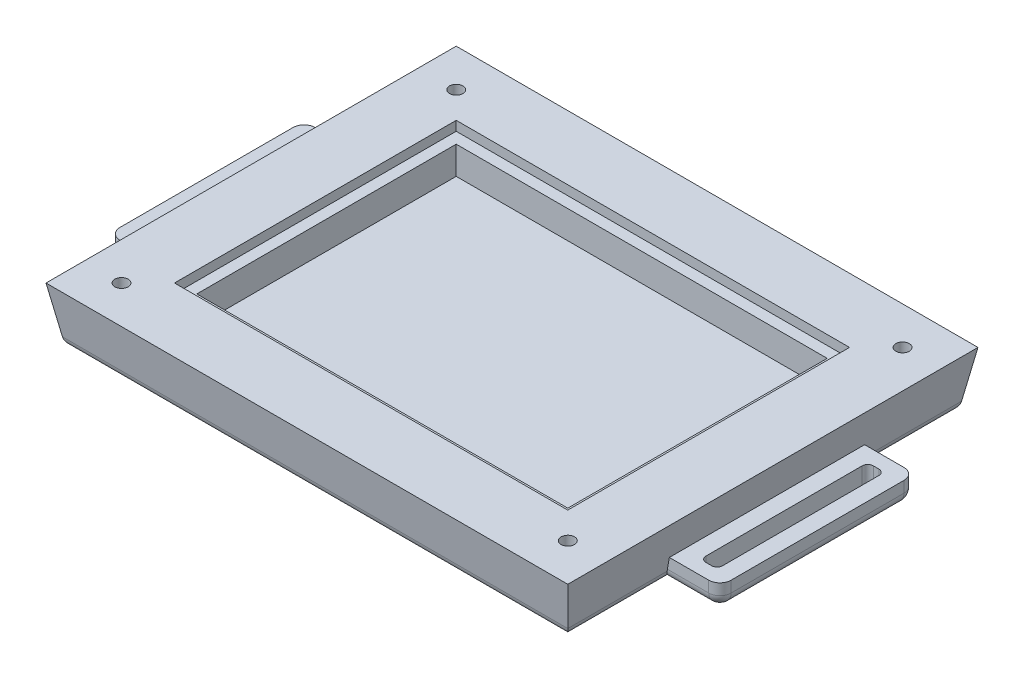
ISO-10303-21;
HEADER;
FILE_DESCRIPTION(('STEP AP214'),'2;1');
FILE_NAME('part.step','',(''),(''),'','','');
FILE_SCHEMA(('AUTOMOTIVE_DESIGN { 1 0 10303 214 1 1 1 1 }'));
ENDSEC;
DATA;
#1=APPLICATION_CONTEXT('core data for automotive mechanical design processes');
#2=APPLICATION_PROTOCOL_DEFINITION('international standard','automotive_design',2000,#1);
#3=PRODUCT_CONTEXT('',#1,'mechanical');
#4=PRODUCT('Part','Part','',(#3));
#5=PRODUCT_RELATED_PRODUCT_CATEGORY('part','',(#4));
#6=PRODUCT_DEFINITION_FORMATION('','',#4);
#7=PRODUCT_DEFINITION_CONTEXT('part definition',#1,'design');
#8=PRODUCT_DEFINITION('design','',#6,#7);
#9=PRODUCT_DEFINITION_SHAPE('','',#8);
#10=(LENGTH_UNIT() NAMED_UNIT(*) SI_UNIT(.MILLI.,.METRE.));
#11=(NAMED_UNIT(*) PLANE_ANGLE_UNIT() SI_UNIT($,.RADIAN.));
#12=(NAMED_UNIT(*) SI_UNIT($,.STERADIAN.) SOLID_ANGLE_UNIT());
#13=UNCERTAINTY_MEASURE_WITH_UNIT(LENGTH_MEASURE(1.E-05),#10,'distance_accuracy_value','');
#14=(GEOMETRIC_REPRESENTATION_CONTEXT(3) GLOBAL_UNCERTAINTY_ASSIGNED_CONTEXT((#13)) GLOBAL_UNIT_ASSIGNED_CONTEXT((#10,
#11,#12)) REPRESENTATION_CONTEXT('',''));
#15=CARTESIAN_POINT('',(0.,0.,0.));
#16=DIRECTION('',(0.,0.,1.));
#17=DIRECTION('',(1.,0.,0.));
#18=AXIS2_PLACEMENT_3D('',#15,#16,#17);
#19=CARTESIAN_POINT('',(0.,0.,0.));
#20=DIRECTION('',(0.,-1.,0.));
#21=DIRECTION('',(0.,0.,-1.));
#22=AXIS2_PLACEMENT_3D('',#19,#20,#21);
#23=PLANE('',#22);
#24=DIRECTION('',(1.,0.,0.));
#25=VECTOR('',#24,1.);
#26=CARTESIAN_POINT('',(45.,0.,-33.3218007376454));
#27=LINE('',#26,#25);
#28=CARTESIAN_POINT('',(-43.3218007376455,0.,-33.3218007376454));
#29=VERTEX_POINT('',#28);
#30=CARTESIAN_POINT('',(43.3218007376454,0.,-33.3218007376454));
#31=VERTEX_POINT('',#30);
#32=EDGE_CURVE('E684',#29,#31,#27,.T.);
#33=ORIENTED_EDGE('',*,*,#32,.T.);
#34=DIRECTION('',(0.,0.,1.));
#35=VECTOR('',#34,1.);
#36=CARTESIAN_POINT('',(43.3218007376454,0.,-17.5));
#37=LINE('',#36,#35);
#38=CARTESIAN_POINT('',(43.3218007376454,0.,-15.5));
#39=VERTEX_POINT('',#38);
#40=EDGE_CURVE('E686',#31,#39,#37,.T.);
#41=ORIENTED_EDGE('',*,*,#40,.T.);
#42=DIRECTION('',(1.,0.,0.));
#43=VECTOR('',#42,1.);
#44=CARTESIAN_POINT('',(0.,0.,-15.5));
#45=LINE('',#44,#43);
#46=CARTESIAN_POINT('',(52.7632698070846,0.,-15.5));
#47=VERTEX_POINT('',#46);
#48=EDGE_CURVE('E679',#39,#47,#45,.T.);
#49=ORIENTED_EDGE('',*,*,#48,.T.);
#50=DIRECTION('',(0.,0.,-1.));
#51=VECTOR('',#50,1.);
#52=CARTESIAN_POINT('',(52.7632698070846,0.,0.));
#53=LINE('',#52,#51);
#54=CARTESIAN_POINT('',(52.7632698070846,0.,15.5));
#55=VERTEX_POINT('',#54);
#56=EDGE_CURVE('E677',#47,#55,#53,.F.);
#57=ORIENTED_EDGE('',*,*,#56,.T.);
#58=DIRECTION('',(1.,0.,0.));
#59=VECTOR('',#58,1.);
#60=CARTESIAN_POINT('',(0.,0.,15.5));
#61=LINE('',#60,#59);
#62=CARTESIAN_POINT('',(43.3218007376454,0.,15.5));
#63=VERTEX_POINT('',#62);
#64=EDGE_CURVE('E671',#55,#63,#61,.F.);
#65=ORIENTED_EDGE('',*,*,#64,.T.);
#66=DIRECTION('',(0.,0.,1.));
#67=VECTOR('',#66,1.);
#68=CARTESIAN_POINT('',(43.3218007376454,0.,35.));
#69=LINE('',#68,#67);
#70=CARTESIAN_POINT('',(43.3218007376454,0.,33.3218007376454));
#71=VERTEX_POINT('',#70);
#72=EDGE_CURVE('E669',#63,#71,#69,.T.);
#73=ORIENTED_EDGE('',*,*,#72,.T.);
#74=DIRECTION('',(-1.,0.,0.));
#75=VECTOR('',#74,1.);
#76=CARTESIAN_POINT('',(-45.,0.,33.3218007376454));
#77=LINE('',#76,#75);
#78=CARTESIAN_POINT('',(-43.3218007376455,0.,33.3218007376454));
#79=VERTEX_POINT('',#78);
#80=EDGE_CURVE('E663',#71,#79,#77,.T.);
#81=ORIENTED_EDGE('',*,*,#80,.T.);
#82=DIRECTION('',(0.,0.,-1.));
#83=VECTOR('',#82,1.);
#84=CARTESIAN_POINT('',(-43.3218007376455,0.,17.5));
#85=LINE('',#84,#83);
#86=CARTESIAN_POINT('',(-43.3218007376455,0.,15.5));
#87=VERTEX_POINT('',#86);
#88=EDGE_CURVE('E665',#79,#87,#85,.T.);
#89=ORIENTED_EDGE('',*,*,#88,.T.);
#90=DIRECTION('',(-1.,0.,0.));
#91=VECTOR('',#90,1.);
#92=CARTESIAN_POINT('',(-52.7632698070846,0.,15.5));
#93=LINE('',#92,#91);
#94=CARTESIAN_POINT('',(-52.7632698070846,0.,15.5));
#95=VERTEX_POINT('',#94);
#96=EDGE_CURVE('E667',#87,#95,#93,.T.);
#97=ORIENTED_EDGE('',*,*,#96,.T.);
#98=DIRECTION('',(0.,0.,-1.));
#99=VECTOR('',#98,1.);
#100=CARTESIAN_POINT('',(-52.7632698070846,0.,0.));
#101=LINE('',#100,#99);
#102=CARTESIAN_POINT('',(-52.7632698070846,0.,-15.5));
#103=VERTEX_POINT('',#102);
#104=EDGE_CURVE('E673',#95,#103,#101,.T.);
#105=ORIENTED_EDGE('',*,*,#104,.T.);
#106=DIRECTION('',(-1.,0.,0.));
#107=VECTOR('',#106,1.);
#108=CARTESIAN_POINT('',(-45.,0.,-15.5));
#109=LINE('',#108,#107);
#110=CARTESIAN_POINT('',(-43.3218007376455,0.,-15.5));
#111=VERTEX_POINT('',#110);
#112=EDGE_CURVE('E675',#103,#111,#109,.F.);
#113=ORIENTED_EDGE('',*,*,#112,.T.);
#114=DIRECTION('',(0.,0.,-1.));
#115=VECTOR('',#114,1.);
#116=CARTESIAN_POINT('',(-43.3218007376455,0.,-35.));
#117=LINE('',#116,#115);
#118=EDGE_CURVE('E682',#111,#29,#117,.T.);
#119=ORIENTED_EDGE('',*,*,#118,.T.);
#120=EDGE_LOOP('',(#33,#41,#49,#57,#65,#73,#81,#89,#97,#105,#113,#119));
#121=FACE_BOUND('',#120,.T.);
#122=CARTESIAN_POINT('',(50.7632698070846,0.,14.));
#123=DIRECTION('',(0.,1.,0.));
#124=DIRECTION('',(0.,0.,1.));
#125=AXIS2_PLACEMENT_3D('',#122,#123,#124);
#126=CIRCLE('',#125,1.);
#127=CARTESIAN_POINT('',(50.7632698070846,0.,15.));
#128=VERTEX_POINT('',#127);
#129=CARTESIAN_POINT('',(51.7632698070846,0.,14.));
#130=VERTEX_POINT('',#129);
#131=EDGE_CURVE('E447',#128,#130,#126,.T.);
#132=ORIENTED_EDGE('',*,*,#131,.T.);
#133=DIRECTION('',(0.,0.,-1.));
#134=VECTOR('',#133,1.);
#135=CARTESIAN_POINT('',(51.7632698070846,0.,14.));
#136=LINE('',#135,#134);
#137=CARTESIAN_POINT('',(51.7632698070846,0.,-14.));
#138=VERTEX_POINT('',#137);
#139=EDGE_CURVE('E450',#130,#138,#136,.T.);
#140=ORIENTED_EDGE('',*,*,#139,.T.);
#141=CARTESIAN_POINT('',(50.7632698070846,0.,-14.));
#142=DIRECTION('',(0.,1.,0.));
#143=DIRECTION('',(0.,0.,-1.));
#144=AXIS2_PLACEMENT_3D('',#141,#142,#143);
#145=CIRCLE('',#144,1.);
#146=CARTESIAN_POINT('',(50.7632698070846,0.,-15.));
#147=VERTEX_POINT('',#146);
#148=EDGE_CURVE('E454',#138,#147,#145,.T.);
#149=ORIENTED_EDGE('',*,*,#148,.T.);
#150=DIRECTION('',(-1.,0.,0.));
#151=VECTOR('',#150,1.);
#152=CARTESIAN_POINT('',(49.7632698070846,0.,-15.));
#153=LINE('',#152,#151);
#154=CARTESIAN_POINT('',(49.7632698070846,0.,-15.));
#155=VERTEX_POINT('',#154);
#156=EDGE_CURVE('E457',#147,#155,#153,.T.);
#157=ORIENTED_EDGE('',*,*,#156,.T.);
#158=CARTESIAN_POINT('',(49.7632698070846,0.,-14.));
#159=DIRECTION('',(0.,1.,0.));
#160=DIRECTION('',(0.,0.,-1.));
#161=AXIS2_PLACEMENT_3D('',#158,#159,#160);
#162=CIRCLE('',#161,1.);
#163=CARTESIAN_POINT('',(48.7632698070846,0.,-14.));
#164=VERTEX_POINT('',#163);
#165=EDGE_CURVE('E460',#155,#164,#162,.T.);
#166=ORIENTED_EDGE('',*,*,#165,.T.);
#167=DIRECTION('',(0.,0.,1.));
#168=VECTOR('',#167,1.);
#169=CARTESIAN_POINT('',(48.7632698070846,0.,14.));
#170=LINE('',#169,#168);
#171=CARTESIAN_POINT('',(48.7632698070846,0.,14.));
#172=VERTEX_POINT('',#171);
#173=EDGE_CURVE('E463',#164,#172,#170,.T.);
#174=ORIENTED_EDGE('',*,*,#173,.T.);
#175=CARTESIAN_POINT('',(49.7632698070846,0.,14.));
#176=DIRECTION('',(0.,1.,0.));
#177=DIRECTION('',(0.,0.,-1.));
#178=AXIS2_PLACEMENT_3D('',#175,#176,#177);
#179=CIRCLE('',#178,1.);
#180=CARTESIAN_POINT('',(49.7632698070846,0.,15.));
#181=VERTEX_POINT('',#180);
#182=EDGE_CURVE('E466',#172,#181,#179,.T.);
#183=ORIENTED_EDGE('',*,*,#182,.T.);
#184=DIRECTION('',(1.,0.,0.));
#185=VECTOR('',#184,1.);
#186=CARTESIAN_POINT('',(49.7632698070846,0.,15.));
#187=LINE('',#186,#185);
#188=EDGE_CURVE('E469',#181,#128,#187,.T.);
#189=ORIENTED_EDGE('',*,*,#188,.T.);
#190=EDGE_LOOP('',(#132,#140,#149,#157,#166,#174,#183,#189));
#191=FACE_BOUND('',#190,.T.);
#192=DIRECTION('',(0.,0.,-1.));
#193=VECTOR('',#192,1.);
#194=CARTESIAN_POINT('',(-51.7632698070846,0.,14.));
#195=LINE('',#194,#193);
#196=CARTESIAN_POINT('',(-51.7632698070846,0.,14.));
#197=VERTEX_POINT('',#196);
#198=CARTESIAN_POINT('',(-51.7632698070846,0.,-14.));
#199=VERTEX_POINT('',#198);
#200=EDGE_CURVE('E379',#197,#199,#195,.T.);
#201=ORIENTED_EDGE('',*,*,#200,.F.);
#202=CARTESIAN_POINT('',(-50.7632698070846,0.,14.));
#203=DIRECTION('',(0.,-1.,0.));
#204=DIRECTION('',(0.,0.,1.));
#205=AXIS2_PLACEMENT_3D('',#202,#203,#204);
#206=CIRCLE('',#205,1.);
#207=CARTESIAN_POINT('',(-50.7632698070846,0.,15.));
#208=VERTEX_POINT('',#207);
#209=EDGE_CURVE('E371',#208,#197,#206,.T.);
#210=ORIENTED_EDGE('',*,*,#209,.F.);
#211=DIRECTION('',(-1.,0.,0.));
#212=VECTOR('',#211,1.);
#213=CARTESIAN_POINT('',(-49.7632698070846,0.,15.));
#214=LINE('',#213,#212);
#215=CARTESIAN_POINT('',(-49.7632698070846,0.,15.));
#216=VERTEX_POINT('',#215);
#217=EDGE_CURVE('E359',#216,#208,#214,.T.);
#218=ORIENTED_EDGE('',*,*,#217,.F.);
#219=CARTESIAN_POINT('',(-49.7632698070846,0.,14.));
#220=DIRECTION('',(0.,-1.,0.));
#221=DIRECTION('',(0.,0.,-1.));
#222=AXIS2_PLACEMENT_3D('',#219,#220,#221);
#223=CIRCLE('',#222,1.);
#224=CARTESIAN_POINT('',(-48.7632698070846,0.,14.));
#225=VERTEX_POINT('',#224);
#226=EDGE_CURVE('E370',#225,#216,#223,.T.);
#227=ORIENTED_EDGE('',*,*,#226,.F.);
#228=DIRECTION('',(0.,0.,1.));
#229=VECTOR('',#228,1.);
#230=CARTESIAN_POINT('',(-48.7632698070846,0.,14.));
#231=LINE('',#230,#229);
#232=CARTESIAN_POINT('',(-48.7632698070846,0.,-14.));
#233=VERTEX_POINT('',#232);
#234=EDGE_CURVE('E390',#233,#225,#231,.T.);
#235=ORIENTED_EDGE('',*,*,#234,.F.);
#236=CARTESIAN_POINT('',(-49.7632698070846,0.,-14.));
#237=DIRECTION('',(0.,-1.,0.));
#238=DIRECTION('',(0.,0.,-1.));
#239=AXIS2_PLACEMENT_3D('',#236,#237,#238);
#240=CIRCLE('',#239,1.);
#241=CARTESIAN_POINT('',(-49.7632698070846,0.,-15.));
#242=VERTEX_POINT('',#241);
#243=EDGE_CURVE('E392',#242,#233,#240,.T.);
#244=ORIENTED_EDGE('',*,*,#243,.F.);
#245=DIRECTION('',(1.,0.,0.));
#246=VECTOR('',#245,1.);
#247=CARTESIAN_POINT('',(-49.7632698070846,0.,-15.));
#248=LINE('',#247,#246);
#249=CARTESIAN_POINT('',(-50.7632698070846,0.,-15.));
#250=VERTEX_POINT('',#249);
#251=EDGE_CURVE('E394',#250,#242,#248,.T.);
#252=ORIENTED_EDGE('',*,*,#251,.F.);
#253=CARTESIAN_POINT('',(-50.7632698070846,0.,-14.));
#254=DIRECTION('',(0.,-1.,0.));
#255=DIRECTION('',(0.,0.,-1.));
#256=AXIS2_PLACEMENT_3D('',#253,#254,#255);
#257=CIRCLE('',#256,1.);
#258=EDGE_CURVE('E396',#199,#250,#257,.T.);
#259=ORIENTED_EDGE('',*,*,#258,.F.);
#260=EDGE_LOOP('',(#201,#210,#218,#227,#235,#244,#252,#259));
#261=FACE_BOUND('',#260,.T.);
#262=ADVANCED_FACE('F39',(#121,#191,#261),#23,.T.);
#263=CARTESIAN_POINT('',(54.7652698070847,4.,17.5));
#264=DIRECTION('',(0.,-1.,0.));
#265=DIRECTION('',(0.,0.,-1.));
#266=AXIS2_PLACEMENT_3D('',#263,#264,#265);
#267=PLANE('',#266);
#268=DIRECTION('',(-1.,0.,0.));
#269=VECTOR('',#268,1.);
#270=CARTESIAN_POINT('',(54.7652698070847,4.,-17.5));
#271=LINE('',#270,#269);
#272=CARTESIAN_POINT('',(-45.7053079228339,4.,-17.5));
#273=VERTEX_POINT('',#272);
#274=CARTESIAN_POINT('',(-52.7632698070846,4.,-17.5));
#275=VERTEX_POINT('',#274);
#276=EDGE_CURVE('E433',#273,#275,#271,.T.);
#277=ORIENTED_EDGE('',*,*,#276,.T.);
#278=CARTESIAN_POINT('',(-52.7632698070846,4.,-15.5));
#279=DIRECTION('',(0.,-1.,0.));
#280=DIRECTION('',(0.,0.,-1.));
#281=AXIS2_PLACEMENT_3D('',#278,#279,#280);
#282=CIRCLE('',#281,2.);
#283=CARTESIAN_POINT('',(-54.7632698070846,4.,-15.5));
#284=VERTEX_POINT('',#283);
#285=EDGE_CURVE('E653',#275,#284,#282,.F.);
#286=ORIENTED_EDGE('',*,*,#285,.T.);
#287=DIRECTION('',(0.,0.,1.));
#288=VECTOR('',#287,1.);
#289=CARTESIAN_POINT('',(-54.7632698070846,4.,17.5));
#290=LINE('',#289,#288);
#291=CARTESIAN_POINT('',(-54.7632698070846,4.,15.5));
#292=VERTEX_POINT('',#291);
#293=EDGE_CURVE('E418',#284,#292,#290,.T.);
#294=ORIENTED_EDGE('',*,*,#293,.T.);
#295=CARTESIAN_POINT('',(-52.7632698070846,4.,15.5));
#296=DIRECTION('',(0.,-1.,0.));
#297=DIRECTION('',(0.,0.,-1.));
#298=AXIS2_PLACEMENT_3D('',#295,#296,#297);
#299=CIRCLE('',#298,2.);
#300=CARTESIAN_POINT('',(-52.7632698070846,4.,17.5));
#301=VERTEX_POINT('',#300);
#302=EDGE_CURVE('E651',#292,#301,#299,.F.);
#303=ORIENTED_EDGE('',*,*,#302,.T.);
#304=DIRECTION('',(-1.,0.,0.));
#305=VECTOR('',#304,1.);
#306=CARTESIAN_POINT('',(54.7652698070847,4.,17.5));
#307=LINE('',#306,#305);
#308=CARTESIAN_POINT('',(-45.7053079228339,4.,17.5));
#309=VERTEX_POINT('',#308);
#310=EDGE_CURVE('E437',#309,#301,#307,.T.);
#311=ORIENTED_EDGE('',*,*,#310,.F.);
#312=DIRECTION('',(0.,0.,-1.));
#313=VECTOR('',#312,1.);
#314=CARTESIAN_POINT('',(-45.7053079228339,4.,17.5));
#315=LINE('',#314,#313);
#316=EDGE_CURVE('E432',#273,#309,#315,.F.);
#317=ORIENTED_EDGE('',*,*,#316,.F.);
#318=EDGE_LOOP('',(#277,#286,#294,#303,#311,#317));
#319=FACE_BOUND('',#318,.T.);
#320=CARTESIAN_POINT('',(-50.7632698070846,4.,14.));
#321=DIRECTION('',(0.,-1.,0.));
#322=DIRECTION('',(0.,0.,1.));
#323=AXIS2_PLACEMENT_3D('',#320,#321,#322);
#324=CIRCLE('',#323,1.);
#325=CARTESIAN_POINT('',(-50.7632698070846,4.,15.));
#326=VERTEX_POINT('',#325);
#327=CARTESIAN_POINT('',(-51.7632698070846,4.,14.));
#328=VERTEX_POINT('',#327);
#329=EDGE_CURVE('E378',#326,#328,#324,.T.);
#330=ORIENTED_EDGE('',*,*,#329,.T.);
#331=DIRECTION('',(0.,0.,-1.));
#332=VECTOR('',#331,1.);
#333=CARTESIAN_POINT('',(-51.7632698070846,4.,14.));
#334=LINE('',#333,#332);
#335=CARTESIAN_POINT('',(-51.7632698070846,4.,-14.));
#336=VERTEX_POINT('',#335);
#337=EDGE_CURVE('E383',#328,#336,#334,.T.);
#338=ORIENTED_EDGE('',*,*,#337,.T.);
#339=CARTESIAN_POINT('',(-50.7632698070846,4.,-14.));
#340=DIRECTION('',(0.,-1.,0.));
#341=DIRECTION('',(0.,0.,-1.));
#342=AXIS2_PLACEMENT_3D('',#339,#340,#341);
#343=CIRCLE('',#342,1.);
#344=CARTESIAN_POINT('',(-50.7632698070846,4.,-15.));
#345=VERTEX_POINT('',#344);
#346=EDGE_CURVE('E386',#336,#345,#343,.T.);
#347=ORIENTED_EDGE('',*,*,#346,.T.);
#348=DIRECTION('',(1.,0.,0.));
#349=VECTOR('',#348,1.);
#350=CARTESIAN_POINT('',(-49.7632698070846,4.,-15.));
#351=LINE('',#350,#349);
#352=CARTESIAN_POINT('',(-49.7632698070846,4.,-15.));
#353=VERTEX_POINT('',#352);
#354=EDGE_CURVE('E411',#345,#353,#351,.T.);
#355=ORIENTED_EDGE('',*,*,#354,.T.);
#356=CARTESIAN_POINT('',(-49.7632698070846,4.,-14.));
#357=DIRECTION('',(0.,-1.,0.));
#358=DIRECTION('',(0.,0.,-1.));
#359=AXIS2_PLACEMENT_3D('',#356,#357,#358);
#360=CIRCLE('',#359,1.);
#361=CARTESIAN_POINT('',(-48.7632698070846,4.,-14.));
#362=VERTEX_POINT('',#361);
#363=EDGE_CURVE('E408',#353,#362,#360,.T.);
#364=ORIENTED_EDGE('',*,*,#363,.T.);
#365=DIRECTION('',(0.,0.,1.));
#366=VECTOR('',#365,1.);
#367=CARTESIAN_POINT('',(-48.7632698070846,4.,14.));
#368=LINE('',#367,#366);
#369=CARTESIAN_POINT('',(-48.7632698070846,4.,14.));
#370=VERTEX_POINT('',#369);
#371=EDGE_CURVE('E405',#362,#370,#368,.T.);
#372=ORIENTED_EDGE('',*,*,#371,.T.);
#373=CARTESIAN_POINT('',(-49.7632698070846,4.,14.));
#374=DIRECTION('',(0.,-1.,0.));
#375=DIRECTION('',(0.,0.,-1.));
#376=AXIS2_PLACEMENT_3D('',#373,#374,#375);
#377=CIRCLE('',#376,1.);
#378=CARTESIAN_POINT('',(-49.7632698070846,4.,15.));
#379=VERTEX_POINT('',#378);
#380=EDGE_CURVE('E402',#370,#379,#377,.T.);
#381=ORIENTED_EDGE('',*,*,#380,.T.);
#382=DIRECTION('',(-1.,0.,0.));
#383=VECTOR('',#382,1.);
#384=CARTESIAN_POINT('',(-49.7632698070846,4.,15.));
#385=LINE('',#384,#383);
#386=EDGE_CURVE('E400',#379,#326,#385,.T.);
#387=ORIENTED_EDGE('',*,*,#386,.T.);
#388=EDGE_LOOP('',(#330,#338,#347,#355,#364,#372,#381,#387));
#389=FACE_BOUND('',#388,.T.);
#390=ADVANCED_FACE('F789',(#319,#389),#267,.F.);
#391=CARTESIAN_POINT('',(45.,0.,35.));
#392=DIRECTION('',(0.984807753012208,-0.173648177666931,0.));
#393=DIRECTION('',(0.173648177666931,0.984807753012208,0.));
#394=AXIS2_PLACEMENT_3D('',#391,#392,#393);
#395=PLANE('',#394);
#396=DIRECTION('',(-0.171087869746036,-0.970287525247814,-0.171087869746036));
#397=VECTOR('',#396,1.);
#398=CARTESIAN_POINT('',(45.,0.,35.));
#399=LINE('',#398,#397);
#400=CARTESIAN_POINT('',(46.7632698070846,10.,36.7632698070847));
#401=VERTEX_POINT('',#400);
#402=CARTESIAN_POINT('',(45.2914162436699,1.65270364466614,35.2914162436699));
#403=VERTEX_POINT('',#402);
#404=EDGE_CURVE('E620',#401,#403,#399,.T.);
#405=ORIENTED_EDGE('',*,*,#404,.T.);
#406=DIRECTION('',(0.,0.,-1.));
#407=VECTOR('',#406,1.);
#408=CARTESIAN_POINT('',(45.2914162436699,1.65270364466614,17.5));
#409=LINE('',#408,#407);
#410=CARTESIAN_POINT('',(45.2914162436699,1.65270364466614,17.4696155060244));
#411=VERTEX_POINT('',#410);
#412=EDGE_CURVE('E63',#403,#411,#409,.T.);
#413=ORIENTED_EDGE('',*,*,#412,.T.);
#414=CARTESIAN_POINT('',(45.3526539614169,2.,15.5));
#415=DIRECTION('',(0.984807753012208,-0.173648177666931,0.));
#416=DIRECTION('',(0.173648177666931,0.984807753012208,0.));
#417=AXIS2_PLACEMENT_3D('',#414,#415,#416);
#418=ELLIPSE('',#417,2.03085322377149,2.);
#419=CARTESIAN_POINT('',(45.3526539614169,2.,17.5));
#420=VERTEX_POINT('',#419);
#421=EDGE_CURVE('E48',#411,#420,#418,.F.);
#422=ORIENTED_EDGE('',*,*,#421,.T.);
#423=DIRECTION('',(0.173648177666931,0.984807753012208,0.));
#424=VECTOR('',#423,1.);
#425=CARTESIAN_POINT('',(42.9169788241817,-11.8134001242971,17.5));
#426=LINE('',#425,#424);
#427=CARTESIAN_POINT('',(45.7053079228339,4.,17.5));
#428=VERTEX_POINT('',#427);
#429=EDGE_CURVE('E518',#428,#420,#426,.F.);
#430=ORIENTED_EDGE('',*,*,#429,.F.);
#431=DIRECTION('',(0.,0.,-1.));
#432=VECTOR('',#431,1.);
#433=CARTESIAN_POINT('',(45.7053079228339,4.,17.5));
#434=LINE('',#433,#432);
#435=CARTESIAN_POINT('',(45.7053079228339,4.,-17.5));
#436=VERTEX_POINT('',#435);
#437=EDGE_CURVE('E515',#436,#428,#434,.F.);
#438=ORIENTED_EDGE('',*,*,#437,.F.);
#439=DIRECTION('',(-0.173648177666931,-0.984807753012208,0.));
#440=VECTOR('',#439,1.);
#441=CARTESIAN_POINT('',(42.9169788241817,-11.8134001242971,-17.5));
#442=LINE('',#441,#440);
#443=CARTESIAN_POINT('',(45.3526539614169,2.,-17.5));
#444=VERTEX_POINT('',#443);
#445=EDGE_CURVE('E513',#444,#436,#442,.F.);
#446=ORIENTED_EDGE('',*,*,#445,.F.);
#447=CARTESIAN_POINT('',(45.3526539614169,2.,-15.5));
#448=DIRECTION('',(0.984807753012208,-0.173648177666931,0.));
#449=DIRECTION('',(0.173648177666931,0.984807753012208,0.));
#450=AXIS2_PLACEMENT_3D('',#447,#448,#449);
#451=ELLIPSE('',#450,2.03085322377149,2.);
#452=CARTESIAN_POINT('',(45.2914162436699,1.65270364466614,-17.4696155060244));
#453=VERTEX_POINT('',#452);
#454=EDGE_CURVE('E719',#444,#453,#451,.F.);
#455=ORIENTED_EDGE('',*,*,#454,.T.);
#456=DIRECTION('',(0.,0.,-1.));
#457=VECTOR('',#456,1.);
#458=CARTESIAN_POINT('',(45.2914162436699,1.65270364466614,-35.));
#459=LINE('',#458,#457);
#460=CARTESIAN_POINT('',(45.2914162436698,1.65270364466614,-35.2914162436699));
#461=VERTEX_POINT('',#460);
#462=EDGE_CURVE('E707',#453,#461,#459,.T.);
#463=ORIENTED_EDGE('',*,*,#462,.T.);
#464=DIRECTION('',(-0.171087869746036,-0.970287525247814,0.171087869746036));
#465=VECTOR('',#464,1.);
#466=CARTESIAN_POINT('',(42.3656046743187,-14.9403983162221,-32.3656046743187));
#467=LINE('',#466,#465);
#468=CARTESIAN_POINT('',(46.7632698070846,10.,-36.7632698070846));
#469=VERTEX_POINT('',#468);
#470=EDGE_CURVE('E624',#469,#461,#467,.T.);
#471=ORIENTED_EDGE('',*,*,#470,.F.);
#472=DIRECTION('',(0.,0.,1.));
#473=VECTOR('',#472,1.);
#474=CARTESIAN_POINT('',(46.7632698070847,10.,0.));
#475=LINE('',#474,#473);
#476=EDGE_CURVE('E633',#401,#469,#475,.F.);
#477=ORIENTED_EDGE('',*,*,#476,.F.);
#478=EDGE_LOOP('',(#405,#413,#422,#430,#438,#446,#455,#463,#471,#477));
#479=FACE_BOUND('',#478,.T.);
#480=ADVANCED_FACE('F822',(#479),#395,.T.);
#481=CARTESIAN_POINT('',(0.,8.3,0.));
#482=DIRECTION('',(0.,-1.,0.));
#483=DIRECTION('',(0.,0.,-1.));
#484=AXIS2_PLACEMENT_3D('',#481,#482,#483);
#485=PLANE('',#484);
#486=DIRECTION('',(0.,0.,-1.));
#487=VECTOR('',#486,1.);
#488=CARTESIAN_POINT('',(35.25,8.3,25.25));
#489=LINE('',#488,#487);
#490=CARTESIAN_POINT('',(35.25,8.3,25.25));
#491=VERTEX_POINT('',#490);
#492=CARTESIAN_POINT('',(35.25,8.3,-25.25));
#493=VERTEX_POINT('',#492);
#494=EDGE_CURVE('E584',#491,#493,#489,.T.);
#495=ORIENTED_EDGE('',*,*,#494,.T.);
#496=DIRECTION('',(-1.,0.,0.));
#497=VECTOR('',#496,1.);
#498=CARTESIAN_POINT('',(-35.25,8.3,-25.25));
#499=LINE('',#498,#497);
#500=CARTESIAN_POINT('',(-35.25,8.3,-25.25));
#501=VERTEX_POINT('',#500);
#502=EDGE_CURVE('E587',#493,#501,#499,.T.);
#503=ORIENTED_EDGE('',*,*,#502,.T.);
#504=DIRECTION('',(0.,0.,1.));
#505=VECTOR('',#504,1.);
#506=CARTESIAN_POINT('',(-35.25,8.3,25.25));
#507=LINE('',#506,#505);
#508=CARTESIAN_POINT('',(-35.25,8.3,25.25));
#509=VERTEX_POINT('',#508);
#510=EDGE_CURVE('E591',#501,#509,#507,.T.);
#511=ORIENTED_EDGE('',*,*,#510,.T.);
#512=DIRECTION('',(1.,0.,0.));
#513=VECTOR('',#512,1.);
#514=CARTESIAN_POINT('',(-35.25,8.3,25.25));
#515=LINE('',#514,#513);
#516=EDGE_CURVE('E594',#509,#491,#515,.T.);
#517=ORIENTED_EDGE('',*,*,#516,.T.);
#518=EDGE_LOOP('',(#495,#503,#511,#517));
#519=FACE_BOUND('',#518,.T.);
#520=DIRECTION('',(0.,0.,-1.));
#521=VECTOR('',#520,1.);
#522=CARTESIAN_POINT('',(33.25,8.3,23.25));
#523=LINE('',#522,#521);
#524=CARTESIAN_POINT('',(33.25,8.3,23.25));
#525=VERTEX_POINT('',#524);
#526=CARTESIAN_POINT('',(33.25,8.3,-23.25));
#527=VERTEX_POINT('',#526);
#528=EDGE_CURVE('E551',#525,#527,#523,.T.);
#529=ORIENTED_EDGE('',*,*,#528,.F.);
#530=DIRECTION('',(1.,0.,0.));
#531=VECTOR('',#530,1.);
#532=CARTESIAN_POINT('',(-33.25,8.3,23.25));
#533=LINE('',#532,#531);
#534=CARTESIAN_POINT('',(-33.25,8.3,23.25));
#535=VERTEX_POINT('',#534);
#536=EDGE_CURVE('E556',#535,#525,#533,.T.);
#537=ORIENTED_EDGE('',*,*,#536,.F.);
#538=DIRECTION('',(0.,0.,1.));
#539=VECTOR('',#538,1.);
#540=CARTESIAN_POINT('',(-33.25,8.3,-23.25));
#541=LINE('',#540,#539);
#542=CARTESIAN_POINT('',(-33.25,8.3,-23.25));
#543=VERTEX_POINT('',#542);
#544=EDGE_CURVE('E571',#543,#535,#541,.T.);
#545=ORIENTED_EDGE('',*,*,#544,.F.);
#546=DIRECTION('',(-1.,0.,0.));
#547=VECTOR('',#546,1.);
#548=CARTESIAN_POINT('',(33.25,8.3,-23.25));
#549=LINE('',#548,#547);
#550=EDGE_CURVE('E568',#527,#543,#549,.T.);
#551=ORIENTED_EDGE('',*,*,#550,.F.);
#552=EDGE_LOOP('',(#529,#537,#545,#551));
#553=FACE_BOUND('',#552,.T.);
#554=ADVANCED_FACE('F832',(#519,#553),#485,.F.);
#555=CARTESIAN_POINT('',(-45.,0.,35.));
#556=DIRECTION('',(-0.984807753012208,-0.173648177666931,0.));
#557=DIRECTION('',(0.173648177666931,-0.984807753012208,0.));
#558=AXIS2_PLACEMENT_3D('',#555,#556,#557);
#559=PLANE('',#558);
#560=DIRECTION('',(0.171087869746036,-0.970287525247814,0.171087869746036));
#561=VECTOR('',#560,1.);
#562=CARTESIAN_POINT('',(-42.9510258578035,-11.6203098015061,-32.9510258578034));
#563=LINE('',#562,#561);
#564=CARTESIAN_POINT('',(-46.7632698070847,10.,-36.7632698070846));
#565=VERTEX_POINT('',#564);
#566=CARTESIAN_POINT('',(-45.2914162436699,1.65270364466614,-35.2914162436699));
#567=VERTEX_POINT('',#566);
#568=EDGE_CURVE('E621',#565,#567,#563,.T.);
#569=ORIENTED_EDGE('',*,*,#568,.T.);
#570=DIRECTION('',(0.,0.,1.));
#571=VECTOR('',#570,1.);
#572=CARTESIAN_POINT('',(-45.2914162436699,1.65270364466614,-17.5));
#573=LINE('',#572,#571);
#574=CARTESIAN_POINT('',(-45.2914162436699,1.65270364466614,-17.4696155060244));
#575=VERTEX_POINT('',#574);
#576=EDGE_CURVE('E713',#567,#575,#573,.T.);
#577=ORIENTED_EDGE('',*,*,#576,.T.);
#578=CARTESIAN_POINT('',(-45.3526539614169,2.,-15.5));
#579=DIRECTION('',(-0.984807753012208,-0.173648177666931,0.));
#580=DIRECTION('',(0.173648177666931,-0.984807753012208,0.));
#581=AXIS2_PLACEMENT_3D('',#578,#579,#580);
#582=ELLIPSE('',#581,2.03085322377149,2.);
#583=CARTESIAN_POINT('',(-45.3526539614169,2.,-17.5));
#584=VERTEX_POINT('',#583);
#585=EDGE_CURVE('E722',#575,#584,#582,.F.);
#586=ORIENTED_EDGE('',*,*,#585,.T.);
#587=DIRECTION('',(0.173648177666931,-0.984807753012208,0.));
#588=VECTOR('',#587,1.);
#589=CARTESIAN_POINT('',(-42.6757493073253,-13.1814806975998,-17.5));
#590=LINE('',#589,#588);
#591=EDGE_CURVE('E440',#584,#273,#590,.F.);
#592=ORIENTED_EDGE('',*,*,#591,.T.);
#593=ORIENTED_EDGE('',*,*,#316,.T.);
#594=DIRECTION('',(-0.173648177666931,0.984807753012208,0.));
#595=VECTOR('',#594,1.);
#596=CARTESIAN_POINT('',(-42.6757493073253,-13.1814806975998,17.5));
#597=LINE('',#596,#595);
#598=CARTESIAN_POINT('',(-45.3526539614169,2.,17.5));
#599=VERTEX_POINT('',#598);
#600=EDGE_CURVE('E442',#309,#599,#597,.F.);
#601=ORIENTED_EDGE('',*,*,#600,.T.);
#602=CARTESIAN_POINT('',(-45.3526539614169,2.,15.5));
#603=DIRECTION('',(-0.984807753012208,-0.173648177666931,0.));
#604=DIRECTION('',(0.173648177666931,-0.984807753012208,0.));
#605=AXIS2_PLACEMENT_3D('',#602,#603,#604);
#606=ELLIPSE('',#605,2.03085322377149,2.);
#607=CARTESIAN_POINT('',(-45.2914162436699,1.65270364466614,17.4696155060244));
#608=VERTEX_POINT('',#607);
#609=EDGE_CURVE('E11',#599,#608,#606,.F.);
#610=ORIENTED_EDGE('',*,*,#609,.T.);
#611=DIRECTION('',(0.,0.,1.));
#612=VECTOR('',#611,1.);
#613=CARTESIAN_POINT('',(-45.2914162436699,1.65270364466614,35.));
#614=LINE('',#613,#612);
#615=CARTESIAN_POINT('',(-45.2914162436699,1.65270364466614,35.2914162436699));
#616=VERTEX_POINT('',#615);
#617=EDGE_CURVE('E56',#608,#616,#614,.T.);
#618=ORIENTED_EDGE('',*,*,#617,.T.);
#619=DIRECTION('',(0.171087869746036,-0.970287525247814,-0.171087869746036));
#620=VECTOR('',#619,1.);
#621=CARTESIAN_POINT('',(-45.,0.,35.));
#622=LINE('',#621,#620);
#623=CARTESIAN_POINT('',(-46.7632698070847,10.,36.7632698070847));
#624=VERTEX_POINT('',#623);
#625=EDGE_CURVE('E616',#624,#616,#622,.T.);
#626=ORIENTED_EDGE('',*,*,#625,.F.);
#627=DIRECTION('',(0.,0.,-1.));
#628=VECTOR('',#627,1.);
#629=CARTESIAN_POINT('',(-46.7632698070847,10.,0.));
#630=LINE('',#629,#628);
#631=EDGE_CURVE('E609',#565,#624,#630,.F.);
#632=ORIENTED_EDGE('',*,*,#631,.F.);
#633=EDGE_LOOP('',(#569,#577,#586,#592,#593,#601,#610,#618,#626,#632));
#634=FACE_BOUND('',#633,.T.);
#635=ADVANCED_FACE('F784',(#634),#559,.T.);
#636=CARTESIAN_POINT('',(-45.,0.,35.));
#637=DIRECTION('',(0.,-0.173648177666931,0.984807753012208));
#638=DIRECTION('',(0.,-0.984807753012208,-0.173648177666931));
#639=AXIS2_PLACEMENT_3D('',#636,#637,#638);
#640=PLANE('',#639);
#641=ORIENTED_EDGE('',*,*,#625,.T.);
#642=DIRECTION('',(1.,0.,0.));
#643=VECTOR('',#642,1.);
#644=CARTESIAN_POINT('',(45.,1.65270364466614,35.2914162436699));
#645=LINE('',#644,#643);
#646=EDGE_CURVE('E717',#616,#403,#645,.T.);
#647=ORIENTED_EDGE('',*,*,#646,.T.);
#648=ORIENTED_EDGE('',*,*,#404,.F.);
#649=DIRECTION('',(-1.,0.,0.));
#650=VECTOR('',#649,1.);
#651=CARTESIAN_POINT('',(0.,10.,36.7632698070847));
#652=LINE('',#651,#650);
#653=EDGE_CURVE('E631',#624,#401,#652,.F.);
#654=ORIENTED_EDGE('',*,*,#653,.F.);
#655=EDGE_LOOP('',(#641,#647,#648,#654));
#656=FACE_BOUND('',#655,.T.);
#657=ADVANCED_FACE('F831',(#656),#640,.T.);
#658=CARTESIAN_POINT('',(-45.,0.,-35.));
#659=DIRECTION('',(0.,-0.173648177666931,-0.984807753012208));
#660=DIRECTION('',(0.,0.984807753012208,-0.173648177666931));
#661=AXIS2_PLACEMENT_3D('',#658,#659,#660);
#662=PLANE('',#661);
#663=ORIENTED_EDGE('',*,*,#470,.T.);
#664=DIRECTION('',(-1.,0.,0.));
#665=VECTOR('',#664,1.);
#666=CARTESIAN_POINT('',(-45.,1.65270364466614,-35.2914162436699));
#667=LINE('',#666,#665);
#668=EDGE_CURVE('E710',#461,#567,#667,.T.);
#669=ORIENTED_EDGE('',*,*,#668,.T.);
#670=ORIENTED_EDGE('',*,*,#568,.F.);
#671=DIRECTION('',(1.,0.,0.));
#672=VECTOR('',#671,1.);
#673=CARTESIAN_POINT('',(0.,10.,-36.7632698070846));
#674=LINE('',#673,#672);
#675=EDGE_CURVE('E625',#469,#565,#674,.F.);
#676=ORIENTED_EDGE('',*,*,#675,.F.);
#677=EDGE_LOOP('',(#663,#669,#670,#676));
#678=FACE_BOUND('',#677,.T.);
#679=ADVANCED_FACE('F833',(#678),#662,.T.);
#680=CARTESIAN_POINT('',(0.,10.,0.));
#681=DIRECTION('',(0.,-1.,0.));
#682=DIRECTION('',(0.,0.,-1.));
#683=AXIS2_PLACEMENT_3D('',#680,#681,#682);
#684=PLANE('',#683);
#685=CARTESIAN_POINT('',(-40.,10.,-30.));
#686=DIRECTION('',(0.,1.,0.));
#687=DIRECTION('',(0.,0.,1.));
#688=AXIS2_PLACEMENT_3D('',#685,#686,#687);
#689=CIRCLE('',#688,1.19999999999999);
#690=CARTESIAN_POINT('',(-40.,10.,-28.8));
#691=VERTEX_POINT('',#690);
#692=EDGE_CURVE('E525',#691,#691,#689,.T.);
#693=ORIENTED_EDGE('',*,*,#692,.F.);
#694=EDGE_LOOP('',(#693));
#695=FACE_BOUND('',#694,.T.);
#696=CARTESIAN_POINT('',(-40.,10.,30.));
#697=DIRECTION('',(0.,1.,0.));
#698=DIRECTION('',(0.,0.,1.));
#699=AXIS2_PLACEMENT_3D('',#696,#697,#698);
#700=CIRCLE('',#699,1.19999999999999);
#701=CARTESIAN_POINT('',(-40.,10.,31.2));
#702=VERTEX_POINT('',#701);
#703=EDGE_CURVE('E533',#702,#702,#700,.T.);
#704=ORIENTED_EDGE('',*,*,#703,.F.);
#705=EDGE_LOOP('',(#704));
#706=FACE_BOUND('',#705,.T.);
#707=CARTESIAN_POINT('',(40.,10.,30.));
#708=DIRECTION('',(0.,1.,0.));
#709=DIRECTION('',(0.,0.,1.));
#710=AXIS2_PLACEMENT_3D('',#707,#708,#709);
#711=CIRCLE('',#710,1.19999999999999);
#712=CARTESIAN_POINT('',(40.,10.,31.2));
#713=VERTEX_POINT('',#712);
#714=EDGE_CURVE('E539',#713,#713,#711,.T.);
#715=ORIENTED_EDGE('',*,*,#714,.F.);
#716=EDGE_LOOP('',(#715));
#717=FACE_BOUND('',#716,.T.);
#718=CARTESIAN_POINT('',(40.,10.,-30.));
#719=DIRECTION('',(0.,1.,0.));
#720=DIRECTION('',(0.,0.,1.));
#721=AXIS2_PLACEMENT_3D('',#718,#719,#720);
#722=CIRCLE('',#721,1.19999999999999);
#723=CARTESIAN_POINT('',(40.,10.,-28.8));
#724=VERTEX_POINT('',#723);
#725=EDGE_CURVE('E545',#724,#724,#722,.T.);
#726=ORIENTED_EDGE('',*,*,#725,.F.);
#727=EDGE_LOOP('',(#726));
#728=FACE_BOUND('',#727,.T.);
#729=DIRECTION('',(-1.,0.,0.));
#730=VECTOR('',#729,1.);
#731=CARTESIAN_POINT('',(-35.25,10.,-25.25));
#732=LINE('',#731,#730);
#733=CARTESIAN_POINT('',(35.25,10.,-25.25));
#734=VERTEX_POINT('',#733);
#735=CARTESIAN_POINT('',(-35.25,10.,-25.25));
#736=VERTEX_POINT('',#735);
#737=EDGE_CURVE('E599',#734,#736,#732,.T.);
#738=ORIENTED_EDGE('',*,*,#737,.F.);
#739=DIRECTION('',(0.,0.,-1.));
#740=VECTOR('',#739,1.);
#741=CARTESIAN_POINT('',(35.25,10.,25.25));
#742=LINE('',#741,#740);
#743=CARTESIAN_POINT('',(35.25,10.,25.25));
#744=VERTEX_POINT('',#743);
#745=EDGE_CURVE('E577',#744,#734,#742,.T.);
#746=ORIENTED_EDGE('',*,*,#745,.F.);
#747=DIRECTION('',(1.,0.,0.));
#748=VECTOR('',#747,1.);
#749=CARTESIAN_POINT('',(-35.25,10.,25.25));
#750=LINE('',#749,#748);
#751=CARTESIAN_POINT('',(-35.25,10.,25.25));
#752=VERTEX_POINT('',#751);
#753=EDGE_CURVE('E588',#752,#744,#750,.T.);
#754=ORIENTED_EDGE('',*,*,#753,.F.);
#755=DIRECTION('',(0.,0.,1.));
#756=VECTOR('',#755,1.);
#757=CARTESIAN_POINT('',(-35.25,10.,25.25));
#758=LINE('',#757,#756);
#759=EDGE_CURVE('E602',#736,#752,#758,.T.);
#760=ORIENTED_EDGE('',*,*,#759,.F.);
#761=EDGE_LOOP('',(#738,#746,#754,#760));
#762=FACE_BOUND('',#761,.T.);
#763=ORIENTED_EDGE('',*,*,#631,.T.);
#764=ORIENTED_EDGE('',*,*,#653,.T.);
#765=ORIENTED_EDGE('',*,*,#476,.T.);
#766=ORIENTED_EDGE('',*,*,#675,.T.);
#767=EDGE_LOOP('',(#763,#764,#765,#766));
#768=FACE_BOUND('',#767,.T.);
#769=ADVANCED_FACE('F827',(#695,#706,#717,#728,#762,#768),#684,.F.);
#770=CARTESIAN_POINT('',(35.25,8.3,25.25));
#771=DIRECTION('',(1.,0.,0.));
#772=DIRECTION('',(0.,0.,-1.));
#773=AXIS2_PLACEMENT_3D('',#770,#771,#772);
#774=PLANE('',#773);
#775=ORIENTED_EDGE('',*,*,#745,.T.);
#776=DIRECTION('',(0.,1.,0.));
#777=VECTOR('',#776,1.);
#778=CARTESIAN_POINT('',(35.25,8.3,-25.25));
#779=LINE('',#778,#777);
#780=EDGE_CURVE('E597',#493,#734,#779,.T.);
#781=ORIENTED_EDGE('',*,*,#780,.F.);
#782=ORIENTED_EDGE('',*,*,#494,.F.);
#783=DIRECTION('',(0.,1.,0.));
#784=VECTOR('',#783,1.);
#785=CARTESIAN_POINT('',(35.25,8.3,25.25));
#786=LINE('',#785,#784);
#787=EDGE_CURVE('E607',#491,#744,#786,.T.);
#788=ORIENTED_EDGE('',*,*,#787,.T.);
#789=EDGE_LOOP('',(#775,#781,#782,#788));
#790=FACE_BOUND('',#789,.T.);
#791=ADVANCED_FACE('F969',(#790),#774,.F.);
#792=CARTESIAN_POINT('',(-35.25,8.3,25.25));
#793=DIRECTION('',(0.,0.,1.));
#794=DIRECTION('',(1.,0.,0.));
#795=AXIS2_PLACEMENT_3D('',#792,#793,#794);
#796=PLANE('',#795);
#797=ORIENTED_EDGE('',*,*,#753,.T.);
#798=ORIENTED_EDGE('',*,*,#787,.F.);
#799=ORIENTED_EDGE('',*,*,#516,.F.);
#800=DIRECTION('',(0.,1.,0.));
#801=VECTOR('',#800,1.);
#802=CARTESIAN_POINT('',(-35.25,8.3,25.25));
#803=LINE('',#802,#801);
#804=EDGE_CURVE('E610',#509,#752,#803,.T.);
#805=ORIENTED_EDGE('',*,*,#804,.T.);
#806=EDGE_LOOP('',(#797,#798,#799,#805));
#807=FACE_BOUND('',#806,.T.);
#808=ADVANCED_FACE('F965',(#807),#796,.F.);
#809=CARTESIAN_POINT('',(-35.25,8.3,25.25));
#810=DIRECTION('',(-1.,0.,0.));
#811=DIRECTION('',(0.,0.,1.));
#812=AXIS2_PLACEMENT_3D('',#809,#810,#811);
#813=PLANE('',#812);
#814=ORIENTED_EDGE('',*,*,#759,.T.);
#815=ORIENTED_EDGE('',*,*,#804,.F.);
#816=ORIENTED_EDGE('',*,*,#510,.F.);
#817=DIRECTION('',(0.,1.,0.));
#818=VECTOR('',#817,1.);
#819=CARTESIAN_POINT('',(-35.25,8.3,-25.25));
#820=LINE('',#819,#818);
#821=EDGE_CURVE('E612',#501,#736,#820,.T.);
#822=ORIENTED_EDGE('',*,*,#821,.T.);
#823=EDGE_LOOP('',(#814,#815,#816,#822));
#824=FACE_BOUND('',#823,.T.);
#825=ADVANCED_FACE('F968',(#824),#813,.F.);
#826=CARTESIAN_POINT('',(-35.25,8.3,-25.25));
#827=DIRECTION('',(0.,0.,-1.));
#828=DIRECTION('',(-1.,0.,0.));
#829=AXIS2_PLACEMENT_3D('',#826,#827,#828);
#830=PLANE('',#829);
#831=ORIENTED_EDGE('',*,*,#737,.T.);
#832=ORIENTED_EDGE('',*,*,#821,.F.);
#833=ORIENTED_EDGE('',*,*,#502,.F.);
#834=ORIENTED_EDGE('',*,*,#780,.T.);
#835=EDGE_LOOP('',(#831,#832,#833,#834));
#836=FACE_BOUND('',#835,.T.);
#837=ADVANCED_FACE('F960',(#836),#830,.F.);
#838=CARTESIAN_POINT('',(33.25,3.3,23.25));
#839=DIRECTION('',(1.,0.,0.));
#840=DIRECTION('',(0.,0.,-1.));
#841=AXIS2_PLACEMENT_3D('',#838,#839,#840);
#842=PLANE('',#841);
#843=ORIENTED_EDGE('',*,*,#528,.T.);
#844=DIRECTION('',(0.,1.,0.));
#845=VECTOR('',#844,1.);
#846=CARTESIAN_POINT('',(33.25,3.3,-23.25));
#847=LINE('',#846,#845);
#848=CARTESIAN_POINT('',(33.25,3.3,-23.25));
#849=VERTEX_POINT('',#848);
#850=EDGE_CURVE('E565',#849,#527,#847,.T.);
#851=ORIENTED_EDGE('',*,*,#850,.F.);
#852=DIRECTION('',(0.,0.,-1.));
#853=VECTOR('',#852,1.);
#854=CARTESIAN_POINT('',(33.25,3.3,23.25));
#855=LINE('',#854,#853);
#856=CARTESIAN_POINT('',(33.25,3.3,23.25));
#857=VERTEX_POINT('',#856);
#858=EDGE_CURVE('E552',#857,#849,#855,.T.);
#859=ORIENTED_EDGE('',*,*,#858,.F.);
#860=DIRECTION('',(0.,1.,0.));
#861=VECTOR('',#860,1.);
#862=CARTESIAN_POINT('',(33.25,3.3,23.25));
#863=LINE('',#862,#861);
#864=EDGE_CURVE('E575',#857,#525,#863,.T.);
#865=ORIENTED_EDGE('',*,*,#864,.T.);
#866=EDGE_LOOP('',(#843,#851,#859,#865));
#867=FACE_BOUND('',#866,.T.);
#868=ADVANCED_FACE('F950',(#867),#842,.F.);
#869=CARTESIAN_POINT('',(-33.25,3.3,23.25));
#870=DIRECTION('',(0.,0.,1.));
#871=DIRECTION('',(1.,0.,0.));
#872=AXIS2_PLACEMENT_3D('',#869,#870,#871);
#873=PLANE('',#872);
#874=ORIENTED_EDGE('',*,*,#536,.T.);
#875=ORIENTED_EDGE('',*,*,#864,.F.);
#876=DIRECTION('',(1.,0.,0.));
#877=VECTOR('',#876,1.);
#878=CARTESIAN_POINT('',(-33.25,3.3,23.25));
#879=LINE('',#878,#877);
#880=CARTESIAN_POINT('',(-33.25,3.3,23.25));
#881=VERTEX_POINT('',#880);
#882=EDGE_CURVE('E562',#881,#857,#879,.T.);
#883=ORIENTED_EDGE('',*,*,#882,.F.);
#884=DIRECTION('',(0.,1.,0.));
#885=VECTOR('',#884,1.);
#886=CARTESIAN_POINT('',(-33.25,3.3,23.25));
#887=LINE('',#886,#885);
#888=EDGE_CURVE('E578',#881,#535,#887,.T.);
#889=ORIENTED_EDGE('',*,*,#888,.T.);
#890=EDGE_LOOP('',(#874,#875,#883,#889));
#891=FACE_BOUND('',#890,.T.);
#892=ADVANCED_FACE('F946',(#891),#873,.F.);
#893=CARTESIAN_POINT('',(-33.25,3.3,-23.25));
#894=DIRECTION('',(-1.,0.,0.));
#895=DIRECTION('',(0.,0.,1.));
#896=AXIS2_PLACEMENT_3D('',#893,#894,#895);
#897=PLANE('',#896);
#898=ORIENTED_EDGE('',*,*,#544,.T.);
#899=ORIENTED_EDGE('',*,*,#888,.F.);
#900=DIRECTION('',(0.,0.,1.));
#901=VECTOR('',#900,1.);
#902=CARTESIAN_POINT('',(-33.25,3.3,-23.25));
#903=LINE('',#902,#901);
#904=CARTESIAN_POINT('',(-33.25,3.3,-23.25));
#905=VERTEX_POINT('',#904);
#906=EDGE_CURVE('E559',#905,#881,#903,.T.);
#907=ORIENTED_EDGE('',*,*,#906,.F.);
#908=DIRECTION('',(0.,1.,0.));
#909=VECTOR('',#908,1.);
#910=CARTESIAN_POINT('',(-33.25,3.3,-23.25));
#911=LINE('',#910,#909);
#912=EDGE_CURVE('E581',#905,#543,#911,.T.);
#913=ORIENTED_EDGE('',*,*,#912,.T.);
#914=EDGE_LOOP('',(#898,#899,#907,#913));
#915=FACE_BOUND('',#914,.T.);
#916=ADVANCED_FACE('F949',(#915),#897,.F.);
#917=CARTESIAN_POINT('',(33.25,3.3,-23.25));
#918=DIRECTION('',(0.,0.,-1.));
#919=DIRECTION('',(-1.,0.,0.));
#920=AXIS2_PLACEMENT_3D('',#917,#918,#919);
#921=PLANE('',#920);
#922=ORIENTED_EDGE('',*,*,#550,.T.);
#923=ORIENTED_EDGE('',*,*,#912,.F.);
#924=DIRECTION('',(-1.,0.,0.));
#925=VECTOR('',#924,1.);
#926=CARTESIAN_POINT('',(33.25,3.3,-23.25));
#927=LINE('',#926,#925);
#928=EDGE_CURVE('E555',#849,#905,#927,.T.);
#929=ORIENTED_EDGE('',*,*,#928,.F.);
#930=ORIENTED_EDGE('',*,*,#850,.T.);
#931=EDGE_LOOP('',(#922,#923,#929,#930));
#932=FACE_BOUND('',#931,.T.);
#933=ADVANCED_FACE('F944',(#932),#921,.F.);
#934=CARTESIAN_POINT('',(0.,3.3,0.));
#935=DIRECTION('',(0.,1.,0.));
#936=DIRECTION('',(0.,0.,1.));
#937=AXIS2_PLACEMENT_3D('',#934,#935,#936);
#938=PLANE('',#937);
#939=ORIENTED_EDGE('',*,*,#858,.T.);
#940=ORIENTED_EDGE('',*,*,#928,.T.);
#941=ORIENTED_EDGE('',*,*,#906,.T.);
#942=ORIENTED_EDGE('',*,*,#882,.T.);
#943=EDGE_LOOP('',(#939,#940,#941,#942));
#944=FACE_BOUND('',#943,.T.);
#945=ADVANCED_FACE('F940',(#944),#938,.T.);
#946=CARTESIAN_POINT('',(40.,5.,-30.));
#947=DIRECTION('',(0.,1.,0.));
#948=DIRECTION('',(0.,0.,1.));
#949=AXIS2_PLACEMENT_3D('',#946,#947,#948);
#950=CONICAL_SURFACE('',#949,1.2,1.02974425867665);
#951=CARTESIAN_POINT('',(40.,4.27896725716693,-30.));
#952=VERTEX_POINT('',#951);
#953=VERTEX_LOOP('',#952);
#954=FACE_BOUND('',#953,.T.);
#955=CARTESIAN_POINT('',(40.,5.,-30.));
#956=DIRECTION('',(0.,1.,0.));
#957=DIRECTION('',(0.,0.,1.));
#958=AXIS2_PLACEMENT_3D('',#955,#956,#957);
#959=CIRCLE('',#958,1.2);
#960=CARTESIAN_POINT('',(40.,5.,-28.8));
#961=VERTEX_POINT('',#960);
#962=EDGE_CURVE('E548',#961,#961,#959,.T.);
#963=ORIENTED_EDGE('',*,*,#962,.T.);
#964=EDGE_LOOP('',(#963));
#965=FACE_BOUND('',#964,.T.);
#966=ADVANCED_FACE('F936',(#954,#965),#950,.F.);
#967=CARTESIAN_POINT('',(40.,10.,-30.));
#968=DIRECTION('',(0.,1.,0.));
#969=DIRECTION('',(0.,0.,1.));
#970=AXIS2_PLACEMENT_3D('',#967,#968,#969);
#971=CYLINDRICAL_SURFACE('',#970,1.2);
#972=ORIENTED_EDGE('',*,*,#962,.F.);
#973=EDGE_LOOP('',(#972));
#974=FACE_BOUND('',#973,.T.);
#975=ORIENTED_EDGE('',*,*,#725,.T.);
#976=EDGE_LOOP('',(#975));
#977=FACE_BOUND('',#976,.T.);
#978=ADVANCED_FACE('F932',(#974,#977),#971,.F.);
#979=CARTESIAN_POINT('',(40.,5.,30.));
#980=DIRECTION('',(0.,1.,0.));
#981=DIRECTION('',(0.,0.,1.));
#982=AXIS2_PLACEMENT_3D('',#979,#980,#981);
#983=CONICAL_SURFACE('',#982,1.2,1.02974425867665);
#984=CARTESIAN_POINT('',(40.,4.27896725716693,30.));
#985=VERTEX_POINT('',#984);
#986=VERTEX_LOOP('',#985);
#987=FACE_BOUND('',#986,.T.);
#988=CARTESIAN_POINT('',(40.,5.,30.));
#989=DIRECTION('',(0.,1.,0.));
#990=DIRECTION('',(0.,0.,1.));
#991=AXIS2_PLACEMENT_3D('',#988,#989,#990);
#992=CIRCLE('',#991,1.2);
#993=CARTESIAN_POINT('',(40.,5.,31.2));
#994=VERTEX_POINT('',#993);
#995=EDGE_CURVE('E542',#994,#994,#992,.T.);
#996=ORIENTED_EDGE('',*,*,#995,.T.);
#997=EDGE_LOOP('',(#996));
#998=FACE_BOUND('',#997,.T.);
#999=ADVANCED_FACE('F928',(#987,#998),#983,.F.);
#1000=CARTESIAN_POINT('',(40.,10.,30.));
#1001=DIRECTION('',(0.,1.,0.));
#1002=DIRECTION('',(0.,0.,1.));
#1003=AXIS2_PLACEMENT_3D('',#1000,#1001,#1002);
#1004=CYLINDRICAL_SURFACE('',#1003,1.2);
#1005=ORIENTED_EDGE('',*,*,#995,.F.);
#1006=EDGE_LOOP('',(#1005));
#1007=FACE_BOUND('',#1006,.T.);
#1008=ORIENTED_EDGE('',*,*,#714,.T.);
#1009=EDGE_LOOP('',(#1008));
#1010=FACE_BOUND('',#1009,.T.);
#1011=ADVANCED_FACE('F924',(#1007,#1010),#1004,.F.);
#1012=CARTESIAN_POINT('',(-40.,5.,30.));
#1013=DIRECTION('',(0.,1.,0.));
#1014=DIRECTION('',(0.,0.,1.));
#1015=AXIS2_PLACEMENT_3D('',#1012,#1013,#1014);
#1016=CONICAL_SURFACE('',#1015,1.2,1.02974425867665);
#1017=CARTESIAN_POINT('',(-40.,4.27896725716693,30.));
#1018=VERTEX_POINT('',#1017);
#1019=VERTEX_LOOP('',#1018);
#1020=FACE_BOUND('',#1019,.T.);
#1021=CARTESIAN_POINT('',(-40.,5.,30.));
#1022=DIRECTION('',(0.,1.,0.));
#1023=DIRECTION('',(0.,0.,1.));
#1024=AXIS2_PLACEMENT_3D('',#1021,#1022,#1023);
#1025=CIRCLE('',#1024,1.2);
#1026=CARTESIAN_POINT('',(-40.,5.,31.2));
#1027=VERTEX_POINT('',#1026);
#1028=EDGE_CURVE('E536',#1027,#1027,#1025,.T.);
#1029=ORIENTED_EDGE('',*,*,#1028,.T.);
#1030=EDGE_LOOP('',(#1029));
#1031=FACE_BOUND('',#1030,.T.);
#1032=ADVANCED_FACE('F920',(#1020,#1031),#1016,.F.);
#1033=CARTESIAN_POINT('',(-40.,10.,30.));
#1034=DIRECTION('',(0.,1.,0.));
#1035=DIRECTION('',(0.,0.,1.));
#1036=AXIS2_PLACEMENT_3D('',#1033,#1034,#1035);
#1037=CYLINDRICAL_SURFACE('',#1036,1.2);
#1038=ORIENTED_EDGE('',*,*,#1028,.F.);
#1039=EDGE_LOOP('',(#1038));
#1040=FACE_BOUND('',#1039,.T.);
#1041=ORIENTED_EDGE('',*,*,#703,.T.);
#1042=EDGE_LOOP('',(#1041));
#1043=FACE_BOUND('',#1042,.T.);
#1044=ADVANCED_FACE('F916',(#1040,#1043),#1037,.F.);
#1045=CARTESIAN_POINT('',(-40.,5.,-30.));
#1046=DIRECTION('',(0.,1.,0.));
#1047=DIRECTION('',(0.,0.,1.));
#1048=AXIS2_PLACEMENT_3D('',#1045,#1046,#1047);
#1049=CONICAL_SURFACE('',#1048,1.2,1.02974425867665);
#1050=CARTESIAN_POINT('',(-40.,4.27896725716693,-30.));
#1051=VERTEX_POINT('',#1050);
#1052=VERTEX_LOOP('',#1051);
#1053=FACE_BOUND('',#1052,.T.);
#1054=CARTESIAN_POINT('',(-40.,5.,-30.));
#1055=DIRECTION('',(0.,1.,0.));
#1056=DIRECTION('',(0.,0.,1.));
#1057=AXIS2_PLACEMENT_3D('',#1054,#1055,#1056);
#1058=CIRCLE('',#1057,1.2);
#1059=CARTESIAN_POINT('',(-40.,5.,-28.8));
#1060=VERTEX_POINT('',#1059);
#1061=EDGE_CURVE('E530',#1060,#1060,#1058,.T.);
#1062=ORIENTED_EDGE('',*,*,#1061,.T.);
#1063=EDGE_LOOP('',(#1062));
#1064=FACE_BOUND('',#1063,.T.);
#1065=ADVANCED_FACE('F912',(#1053,#1064),#1049,.F.);
#1066=CARTESIAN_POINT('',(-40.,10.,-30.));
#1067=DIRECTION('',(0.,1.,0.));
#1068=DIRECTION('',(0.,0.,1.));
#1069=AXIS2_PLACEMENT_3D('',#1066,#1067,#1068);
#1070=CYLINDRICAL_SURFACE('',#1069,1.2);
#1071=ORIENTED_EDGE('',*,*,#1061,.F.);
#1072=EDGE_LOOP('',(#1071));
#1073=FACE_BOUND('',#1072,.T.);
#1074=ORIENTED_EDGE('',*,*,#692,.T.);
#1075=EDGE_LOOP('',(#1074));
#1076=FACE_BOUND('',#1075,.T.);
#1077=ADVANCED_FACE('F902',(#1073,#1076),#1070,.F.);
#1078=CARTESIAN_POINT('',(-46.7652698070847,4.,17.5));
#1079=DIRECTION('',(0.,1.,0.));
#1080=DIRECTION('',(0.,0.,1.));
#1081=AXIS2_PLACEMENT_3D('',#1078,#1079,#1080);
#1082=PLANE('',#1081);
#1083=CARTESIAN_POINT('',(50.7632698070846,4.,14.));
#1084=DIRECTION('',(0.,1.,0.));
#1085=DIRECTION('',(0.,0.,1.));
#1086=AXIS2_PLACEMENT_3D('',#1083,#1084,#1085);
#1087=CIRCLE('',#1086,1.);
#1088=CARTESIAN_POINT('',(50.7632698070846,4.,15.));
#1089=VERTEX_POINT('',#1088);
#1090=CARTESIAN_POINT('',(51.7632698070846,4.,14.));
#1091=VERTEX_POINT('',#1090);
#1092=EDGE_CURVE('E436',#1089,#1091,#1087,.T.);
#1093=ORIENTED_EDGE('',*,*,#1092,.F.);
#1094=DIRECTION('',(1.,0.,0.));
#1095=VECTOR('',#1094,1.);
#1096=CARTESIAN_POINT('',(49.7632698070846,4.,15.));
#1097=LINE('',#1096,#1095);
#1098=CARTESIAN_POINT('',(49.7632698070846,4.,15.));
#1099=VERTEX_POINT('',#1098);
#1100=EDGE_CURVE('E451',#1099,#1089,#1097,.T.);
#1101=ORIENTED_EDGE('',*,*,#1100,.F.);
#1102=CARTESIAN_POINT('',(49.7632698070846,4.,14.));
#1103=DIRECTION('',(0.,1.,0.));
#1104=DIRECTION('',(0.,0.,-1.));
#1105=AXIS2_PLACEMENT_3D('',#1102,#1103,#1104);
#1106=CIRCLE('',#1105,1.);
#1107=CARTESIAN_POINT('',(48.7632698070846,4.,14.));
#1108=VERTEX_POINT('',#1107);
#1109=EDGE_CURVE('E489',#1108,#1099,#1106,.T.);
#1110=ORIENTED_EDGE('',*,*,#1109,.F.);
#1111=DIRECTION('',(0.,0.,1.));
#1112=VECTOR('',#1111,1.);
#1113=CARTESIAN_POINT('',(48.7632698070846,4.,14.));
#1114=LINE('',#1113,#1112);
#1115=CARTESIAN_POINT('',(48.7632698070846,4.,-14.));
#1116=VERTEX_POINT('',#1115);
#1117=EDGE_CURVE('E486',#1116,#1108,#1114,.T.);
#1118=ORIENTED_EDGE('',*,*,#1117,.F.);
#1119=CARTESIAN_POINT('',(49.7632698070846,4.,-14.));
#1120=DIRECTION('',(0.,1.,0.));
#1121=DIRECTION('',(0.,0.,-1.));
#1122=AXIS2_PLACEMENT_3D('',#1119,#1120,#1121);
#1123=CIRCLE('',#1122,1.);
#1124=CARTESIAN_POINT('',(49.7632698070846,4.,-15.));
#1125=VERTEX_POINT('',#1124);
#1126=EDGE_CURVE('E483',#1125,#1116,#1123,.T.);
#1127=ORIENTED_EDGE('',*,*,#1126,.F.);
#1128=DIRECTION('',(-1.,0.,0.));
#1129=VECTOR('',#1128,1.);
#1130=CARTESIAN_POINT('',(49.7632698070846,4.,-15.));
#1131=LINE('',#1130,#1129);
#1132=CARTESIAN_POINT('',(50.7632698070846,4.,-15.));
#1133=VERTEX_POINT('',#1132);
#1134=EDGE_CURVE('E480',#1133,#1125,#1131,.T.);
#1135=ORIENTED_EDGE('',*,*,#1134,.F.);
#1136=CARTESIAN_POINT('',(50.7632698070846,4.,-14.));
#1137=DIRECTION('',(0.,1.,0.));
#1138=DIRECTION('',(0.,0.,-1.));
#1139=AXIS2_PLACEMENT_3D('',#1136,#1137,#1138);
#1140=CIRCLE('',#1139,1.);
#1141=CARTESIAN_POINT('',(51.7632698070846,4.,-14.));
#1142=VERTEX_POINT('',#1141);
#1143=EDGE_CURVE('E477',#1142,#1133,#1140,.T.);
#1144=ORIENTED_EDGE('',*,*,#1143,.F.);
#1145=DIRECTION('',(0.,0.,-1.));
#1146=VECTOR('',#1145,1.);
#1147=CARTESIAN_POINT('',(51.7632698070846,4.,14.));
#1148=LINE('',#1147,#1146);
#1149=EDGE_CURVE('E474',#1091,#1142,#1148,.T.);
#1150=ORIENTED_EDGE('',*,*,#1149,.F.);
#1151=EDGE_LOOP('',(#1093,#1101,#1110,#1118,#1127,#1135,#1144,#1150));
#1152=FACE_BOUND('',#1151,.T.);
#1153=DIRECTION('',(0.,0.,1.));
#1154=VECTOR('',#1153,1.);
#1155=CARTESIAN_POINT('',(54.7632698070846,4.,17.5));
#1156=LINE('',#1155,#1154);
#1157=CARTESIAN_POINT('',(54.7632698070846,4.,-15.5));
#1158=VERTEX_POINT('',#1157);
#1159=CARTESIAN_POINT('',(54.7632698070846,4.,15.5));
#1160=VERTEX_POINT('',#1159);
#1161=EDGE_CURVE('E496',#1158,#1160,#1156,.T.);
#1162=ORIENTED_EDGE('',*,*,#1161,.F.);
#1163=CARTESIAN_POINT('',(52.7632698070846,4.,-15.5));
#1164=DIRECTION('',(0.,1.,0.));
#1165=DIRECTION('',(0.,0.,1.));
#1166=AXIS2_PLACEMENT_3D('',#1163,#1164,#1165);
#1167=CIRCLE('',#1166,2.);
#1168=CARTESIAN_POINT('',(52.7632698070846,4.,-17.5));
#1169=VERTEX_POINT('',#1168);
#1170=EDGE_CURVE('E642',#1158,#1169,#1167,.T.);
#1171=ORIENTED_EDGE('',*,*,#1170,.T.);
#1172=DIRECTION('',(1.,0.,0.));
#1173=VECTOR('',#1172,1.);
#1174=CARTESIAN_POINT('',(-46.7652698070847,4.,-17.5));
#1175=LINE('',#1174,#1173);
#1176=EDGE_CURVE('E521',#436,#1169,#1175,.T.);
#1177=ORIENTED_EDGE('',*,*,#1176,.F.);
#1178=ORIENTED_EDGE('',*,*,#437,.T.);
#1179=DIRECTION('',(1.,0.,0.));
#1180=VECTOR('',#1179,1.);
#1181=CARTESIAN_POINT('',(-46.7652698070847,4.,17.5));
#1182=LINE('',#1181,#1180);
#1183=CARTESIAN_POINT('',(52.7632698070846,4.,17.5));
#1184=VERTEX_POINT('',#1183);
#1185=EDGE_CURVE('E522',#428,#1184,#1182,.T.);
#1186=ORIENTED_EDGE('',*,*,#1185,.T.);
#1187=CARTESIAN_POINT('',(52.7632698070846,4.,15.5));
#1188=DIRECTION('',(0.,1.,0.));
#1189=DIRECTION('',(0.,0.,1.));
#1190=AXIS2_PLACEMENT_3D('',#1187,#1188,#1189);
#1191=CIRCLE('',#1190,2.);
#1192=EDGE_CURVE('E640',#1184,#1160,#1191,.T.);
#1193=ORIENTED_EDGE('',*,*,#1192,.T.);
#1194=EDGE_LOOP('',(#1162,#1171,#1177,#1178,#1186,#1193));
#1195=FACE_BOUND('',#1194,.T.);
#1196=ADVANCED_FACE('F898',(#1152,#1195),#1082,.T.);
#1197=CARTESIAN_POINT('',(-46.7652698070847,4.,-17.5));
#1198=DIRECTION('',(0.,0.,-1.));
#1199=DIRECTION('',(-1.,0.,0.));
#1200=AXIS2_PLACEMENT_3D('',#1197,#1198,#1199);
#1201=PLANE('',#1200);
#1202=DIRECTION('',(0.,1.,0.));
#1203=VECTOR('',#1202,1.);
#1204=CARTESIAN_POINT('',(52.7632698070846,4.,-17.5));
#1205=LINE('',#1204,#1203);
#1206=CARTESIAN_POINT('',(52.7632698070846,2.,-17.5));
#1207=VERTEX_POINT('',#1206);
#1208=EDGE_CURVE('E644',#1169,#1207,#1205,.F.);
#1209=ORIENTED_EDGE('',*,*,#1208,.T.);
#1210=DIRECTION('',(1.,0.,0.));
#1211=VECTOR('',#1210,1.);
#1212=CARTESIAN_POINT('',(-46.7652698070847,2.,-17.5));
#1213=LINE('',#1212,#1211);
#1214=EDGE_CURVE('E688',#1207,#444,#1213,.F.);
#1215=ORIENTED_EDGE('',*,*,#1214,.T.);
#1216=ORIENTED_EDGE('',*,*,#445,.T.);
#1217=ORIENTED_EDGE('',*,*,#1176,.T.);
#1218=EDGE_LOOP('',(#1209,#1215,#1216,#1217));
#1219=FACE_BOUND('',#1218,.T.);
#1220=ADVANCED_FACE('F901',(#1219),#1201,.T.);
#1221=CARTESIAN_POINT('',(-46.7652698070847,4.,17.5));
#1222=DIRECTION('',(0.,0.,1.));
#1223=DIRECTION('',(1.,0.,0.));
#1224=AXIS2_PLACEMENT_3D('',#1221,#1222,#1223);
#1225=PLANE('',#1224);
#1226=ORIENTED_EDGE('',*,*,#429,.T.);
#1227=DIRECTION('',(1.,0.,0.));
#1228=VECTOR('',#1227,1.);
#1229=CARTESIAN_POINT('',(-46.7652698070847,2.,17.5));
#1230=LINE('',#1229,#1228);
#1231=CARTESIAN_POINT('',(52.7632698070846,2.,17.5));
#1232=VERTEX_POINT('',#1231);
#1233=EDGE_CURVE('E705',#420,#1232,#1230,.T.);
#1234=ORIENTED_EDGE('',*,*,#1233,.T.);
#1235=DIRECTION('',(0.,-1.,0.));
#1236=VECTOR('',#1235,1.);
#1237=CARTESIAN_POINT('',(52.7632698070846,4.,17.5));
#1238=LINE('',#1237,#1236);
#1239=EDGE_CURVE('E647',#1232,#1184,#1238,.F.);
#1240=ORIENTED_EDGE('',*,*,#1239,.T.);
#1241=ORIENTED_EDGE('',*,*,#1185,.F.);
#1242=EDGE_LOOP('',(#1226,#1234,#1240,#1241));
#1243=FACE_BOUND('',#1242,.T.);
#1244=ADVANCED_FACE('F896',(#1243),#1225,.T.);
#1245=CARTESIAN_POINT('',(54.7632698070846,0.,0.));
#1246=DIRECTION('',(1.,0.,0.));
#1247=DIRECTION('',(0.,0.,-1.));
#1248=AXIS2_PLACEMENT_3D('',#1245,#1246,#1247);
#1249=PLANE('',#1248);
#1250=DIRECTION('',(0.,-1.,0.));
#1251=VECTOR('',#1250,1.);
#1252=CARTESIAN_POINT('',(54.7632698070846,0.,15.5));
#1253=LINE('',#1252,#1251);
#1254=CARTESIAN_POINT('',(54.7632698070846,2.,15.5));
#1255=VERTEX_POINT('',#1254);
#1256=EDGE_CURVE('E619',#1160,#1255,#1253,.T.);
#1257=ORIENTED_EDGE('',*,*,#1256,.T.);
#1258=DIRECTION('',(0.,0.,-1.));
#1259=VECTOR('',#1258,1.);
#1260=CARTESIAN_POINT('',(54.7632698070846,2.,0.));
#1261=LINE('',#1260,#1259);
#1262=CARTESIAN_POINT('',(54.7632698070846,2.,-15.5));
#1263=VERTEX_POINT('',#1262);
#1264=EDGE_CURVE('E693',#1255,#1263,#1261,.T.);
#1265=ORIENTED_EDGE('',*,*,#1264,.T.);
#1266=DIRECTION('',(0.,1.,0.));
#1267=VECTOR('',#1266,1.);
#1268=CARTESIAN_POINT('',(54.7632698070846,0.,-15.5));
#1269=LINE('',#1268,#1267);
#1270=EDGE_CURVE('E638',#1263,#1158,#1269,.T.);
#1271=ORIENTED_EDGE('',*,*,#1270,.T.);
#1272=ORIENTED_EDGE('',*,*,#1161,.T.);
#1273=EDGE_LOOP('',(#1257,#1265,#1271,#1272));
#1274=FACE_BOUND('',#1273,.T.);
#1275=ADVANCED_FACE('F892',(#1274),#1249,.T.);
#1276=CARTESIAN_POINT('',(50.7632698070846,0.,14.));
#1277=DIRECTION('',(0.,1.,0.));
#1278=DIRECTION('',(0.,0.,1.));
#1279=AXIS2_PLACEMENT_3D('',#1276,#1277,#1278);
#1280=CYLINDRICAL_SURFACE('',#1279,1.);
#1281=ORIENTED_EDGE('',*,*,#1092,.T.);
#1282=DIRECTION('',(0.,1.,0.));
#1283=VECTOR('',#1282,1.);
#1284=CARTESIAN_POINT('',(51.7632698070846,0.,14.));
#1285=LINE('',#1284,#1283);
#1286=EDGE_CURVE('E472',#130,#1091,#1285,.T.);
#1287=ORIENTED_EDGE('',*,*,#1286,.F.);
#1288=ORIENTED_EDGE('',*,*,#131,.F.);
#1289=DIRECTION('',(0.,1.,0.));
#1290=VECTOR('',#1289,1.);
#1291=CARTESIAN_POINT('',(50.7632698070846,0.,15.));
#1292=LINE('',#1291,#1290);
#1293=EDGE_CURVE('E494',#128,#1089,#1292,.T.);
#1294=ORIENTED_EDGE('',*,*,#1293,.T.);
#1295=EDGE_LOOP('',(#1281,#1287,#1288,#1294));
#1296=FACE_BOUND('',#1295,.T.);
#1297=ADVANCED_FACE('F866',(#1296),#1280,.F.);
#1298=CARTESIAN_POINT('',(49.7632698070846,0.,15.));
#1299=DIRECTION('',(0.,0.,1.));
#1300=DIRECTION('',(0.,-1.,0.));
#1301=AXIS2_PLACEMENT_3D('',#1298,#1299,#1300);
#1302=PLANE('',#1301);
#1303=ORIENTED_EDGE('',*,*,#1100,.T.);
#1304=ORIENTED_EDGE('',*,*,#1293,.F.);
#1305=ORIENTED_EDGE('',*,*,#188,.F.);
#1306=DIRECTION('',(0.,1.,0.));
#1307=VECTOR('',#1306,1.);
#1308=CARTESIAN_POINT('',(49.7632698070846,0.,15.));
#1309=LINE('',#1308,#1307);
#1310=EDGE_CURVE('E497',#181,#1099,#1309,.T.);
#1311=ORIENTED_EDGE('',*,*,#1310,.T.);
#1312=EDGE_LOOP('',(#1303,#1304,#1305,#1311));
#1313=FACE_BOUND('',#1312,.T.);
#1314=ADVANCED_FACE('F862',(#1313),#1302,.F.);
#1315=CARTESIAN_POINT('',(49.7632698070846,0.,14.));
#1316=DIRECTION('',(0.,1.,0.));
#1317=DIRECTION('',(0.,0.,1.));
#1318=AXIS2_PLACEMENT_3D('',#1315,#1316,#1317);
#1319=CYLINDRICAL_SURFACE('',#1318,1.);
#1320=ORIENTED_EDGE('',*,*,#1109,.T.);
#1321=ORIENTED_EDGE('',*,*,#1310,.F.);
#1322=ORIENTED_EDGE('',*,*,#182,.F.);
#1323=DIRECTION('',(0.,1.,0.));
#1324=VECTOR('',#1323,1.);
#1325=CARTESIAN_POINT('',(48.7632698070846,0.,14.));
#1326=LINE('',#1325,#1324);
#1327=EDGE_CURVE('E499',#172,#1108,#1326,.T.);
#1328=ORIENTED_EDGE('',*,*,#1327,.T.);
#1329=EDGE_LOOP('',(#1320,#1321,#1322,#1328));
#1330=FACE_BOUND('',#1329,.T.);
#1331=ADVANCED_FACE('F865',(#1330),#1319,.F.);
#1332=CARTESIAN_POINT('',(48.7632698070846,0.,14.));
#1333=DIRECTION('',(-1.,0.,0.));
#1334=DIRECTION('',(0.,0.,1.));
#1335=AXIS2_PLACEMENT_3D('',#1332,#1333,#1334);
#1336=PLANE('',#1335);
#1337=ORIENTED_EDGE('',*,*,#1117,.T.);
#1338=ORIENTED_EDGE('',*,*,#1327,.F.);
#1339=ORIENTED_EDGE('',*,*,#173,.F.);
#1340=DIRECTION('',(0.,1.,0.));
#1341=VECTOR('',#1340,1.);
#1342=CARTESIAN_POINT('',(48.7632698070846,0.,-14.));
#1343=LINE('',#1342,#1341);
#1344=EDGE_CURVE('E501',#164,#1116,#1343,.T.);
#1345=ORIENTED_EDGE('',*,*,#1344,.T.);
#1346=EDGE_LOOP('',(#1337,#1338,#1339,#1345));
#1347=FACE_BOUND('',#1346,.T.);
#1348=ADVANCED_FACE('F870',(#1347),#1336,.F.);
#1349=CARTESIAN_POINT('',(49.7632698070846,0.,-14.));
#1350=DIRECTION('',(0.,1.,0.));
#1351=DIRECTION('',(0.,0.,1.));
#1352=AXIS2_PLACEMENT_3D('',#1349,#1350,#1351);
#1353=CYLINDRICAL_SURFACE('',#1352,1.);
#1354=ORIENTED_EDGE('',*,*,#1126,.T.);
#1355=ORIENTED_EDGE('',*,*,#1344,.F.);
#1356=ORIENTED_EDGE('',*,*,#165,.F.);
#1357=DIRECTION('',(0.,1.,0.));
#1358=VECTOR('',#1357,1.);
#1359=CARTESIAN_POINT('',(49.7632698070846,0.,-15.));
#1360=LINE('',#1359,#1358);
#1361=EDGE_CURVE('E503',#155,#1125,#1360,.T.);
#1362=ORIENTED_EDGE('',*,*,#1361,.T.);
#1363=EDGE_LOOP('',(#1354,#1355,#1356,#1362));
#1364=FACE_BOUND('',#1363,.T.);
#1365=ADVANCED_FACE('F874',(#1364),#1353,.F.);
#1366=CARTESIAN_POINT('',(49.7632698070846,0.,-15.));
#1367=DIRECTION('',(0.,0.,-1.));
#1368=DIRECTION('',(0.,1.,0.));
#1369=AXIS2_PLACEMENT_3D('',#1366,#1367,#1368);
#1370=PLANE('',#1369);
#1371=ORIENTED_EDGE('',*,*,#1134,.T.);
#1372=ORIENTED_EDGE('',*,*,#1361,.F.);
#1373=ORIENTED_EDGE('',*,*,#156,.F.);
#1374=DIRECTION('',(0.,1.,0.));
#1375=VECTOR('',#1374,1.);
#1376=CARTESIAN_POINT('',(50.7632698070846,0.,-15.));
#1377=LINE('',#1376,#1375);
#1378=EDGE_CURVE('E505',#147,#1133,#1377,.T.);
#1379=ORIENTED_EDGE('',*,*,#1378,.T.);
#1380=EDGE_LOOP('',(#1371,#1372,#1373,#1379));
#1381=FACE_BOUND('',#1380,.T.);
#1382=ADVANCED_FACE('F878',(#1381),#1370,.F.);
#1383=CARTESIAN_POINT('',(50.7632698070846,0.,-14.));
#1384=DIRECTION('',(0.,1.,0.));
#1385=DIRECTION('',(0.,0.,1.));
#1386=AXIS2_PLACEMENT_3D('',#1383,#1384,#1385);
#1387=CYLINDRICAL_SURFACE('',#1386,1.);
#1388=ORIENTED_EDGE('',*,*,#1143,.T.);
#1389=ORIENTED_EDGE('',*,*,#1378,.F.);
#1390=ORIENTED_EDGE('',*,*,#148,.F.);
#1391=DIRECTION('',(0.,1.,0.));
#1392=VECTOR('',#1391,1.);
#1393=CARTESIAN_POINT('',(51.7632698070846,0.,-14.));
#1394=LINE('',#1393,#1392);
#1395=EDGE_CURVE('E507',#138,#1142,#1394,.T.);
#1396=ORIENTED_EDGE('',*,*,#1395,.T.);
#1397=EDGE_LOOP('',(#1388,#1389,#1390,#1396));
#1398=FACE_BOUND('',#1397,.T.);
#1399=ADVANCED_FACE('F882',(#1398),#1387,.F.);
#1400=CARTESIAN_POINT('',(51.7632698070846,0.,14.));
#1401=DIRECTION('',(1.,0.,0.));
#1402=DIRECTION('',(0.,0.,-1.));
#1403=AXIS2_PLACEMENT_3D('',#1400,#1401,#1402);
#1404=PLANE('',#1403);
#1405=ORIENTED_EDGE('',*,*,#1149,.T.);
#1406=ORIENTED_EDGE('',*,*,#1395,.F.);
#1407=ORIENTED_EDGE('',*,*,#139,.F.);
#1408=ORIENTED_EDGE('',*,*,#1286,.T.);
#1409=EDGE_LOOP('',(#1405,#1406,#1407,#1408));
#1410=FACE_BOUND('',#1409,.T.);
#1411=ADVANCED_FACE('F846',(#1410),#1404,.F.);
#1412=CARTESIAN_POINT('',(52.7632698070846,0.,-15.5));
#1413=DIRECTION('',(0.,1.,0.));
#1414=DIRECTION('',(0.,0.,1.));
#1415=AXIS2_PLACEMENT_3D('',#1412,#1413,#1414);
#1416=CYLINDRICAL_SURFACE('',#1415,2.);
#1417=ORIENTED_EDGE('',*,*,#1270,.F.);
#1418=CARTESIAN_POINT('',(52.7632698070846,2.,-15.5));
#1419=DIRECTION('',(0.,1.,0.));
#1420=DIRECTION('',(0.,0.,1.));
#1421=AXIS2_PLACEMENT_3D('',#1418,#1419,#1420);
#1422=CIRCLE('',#1421,2.);
#1423=EDGE_CURVE('E691',#1263,#1207,#1422,.T.);
#1424=ORIENTED_EDGE('',*,*,#1423,.T.);
#1425=ORIENTED_EDGE('',*,*,#1208,.F.);
#1426=ORIENTED_EDGE('',*,*,#1170,.F.);
#1427=EDGE_LOOP('',(#1417,#1424,#1425,#1426));
#1428=FACE_BOUND('',#1427,.T.);
#1429=ADVANCED_FACE('F842',(#1428),#1416,.T.);
#1430=CARTESIAN_POINT('',(52.7632698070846,0.,15.5));
#1431=DIRECTION('',(0.,-1.,0.));
#1432=DIRECTION('',(0.,0.,-1.));
#1433=AXIS2_PLACEMENT_3D('',#1430,#1431,#1432);
#1434=CYLINDRICAL_SURFACE('',#1433,2.);
#1435=ORIENTED_EDGE('',*,*,#1239,.F.);
#1436=CARTESIAN_POINT('',(52.7632698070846,2.,15.5));
#1437=DIRECTION('',(0.,-1.,0.));
#1438=DIRECTION('',(0.,0.,-1.));
#1439=AXIS2_PLACEMENT_3D('',#1436,#1437,#1438);
#1440=CIRCLE('',#1439,2.);
#1441=EDGE_CURVE('E695',#1232,#1255,#1440,.F.);
#1442=ORIENTED_EDGE('',*,*,#1441,.T.);
#1443=ORIENTED_EDGE('',*,*,#1256,.F.);
#1444=ORIENTED_EDGE('',*,*,#1192,.F.);
#1445=EDGE_LOOP('',(#1435,#1442,#1443,#1444));
#1446=FACE_BOUND('',#1445,.T.);
#1447=ADVANCED_FACE('F845',(#1446),#1434,.T.);
#1448=CARTESIAN_POINT('',(54.7652698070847,4.,17.5));
#1449=DIRECTION('',(0.,0.,-1.));
#1450=DIRECTION('',(-1.,0.,0.));
#1451=AXIS2_PLACEMENT_3D('',#1448,#1449,#1450);
#1452=PLANE('',#1451);
#1453=DIRECTION('',(0.,-1.,0.));
#1454=VECTOR('',#1453,1.);
#1455=CARTESIAN_POINT('',(-52.7632698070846,0.,17.5));
#1456=LINE('',#1455,#1454);
#1457=CARTESIAN_POINT('',(-52.7632698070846,2.,17.5));
#1458=VERTEX_POINT('',#1457);
#1459=EDGE_CURVE('E660',#301,#1458,#1456,.T.);
#1460=ORIENTED_EDGE('',*,*,#1459,.T.);
#1461=DIRECTION('',(-1.,0.,0.));
#1462=VECTOR('',#1461,1.);
#1463=CARTESIAN_POINT('',(-45.,2.,17.5));
#1464=LINE('',#1463,#1462);
#1465=EDGE_CURVE('E715',#1458,#599,#1464,.F.);
#1466=ORIENTED_EDGE('',*,*,#1465,.T.);
#1467=ORIENTED_EDGE('',*,*,#600,.F.);
#1468=ORIENTED_EDGE('',*,*,#310,.T.);
#1469=EDGE_LOOP('',(#1460,#1466,#1467,#1468));
#1470=FACE_BOUND('',#1469,.T.);
#1471=ADVANCED_FACE('F780',(#1470),#1452,.F.);
#1472=CARTESIAN_POINT('',(54.7652698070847,4.,-17.5));
#1473=DIRECTION('',(0.,0.,1.));
#1474=DIRECTION('',(1.,0.,0.));
#1475=AXIS2_PLACEMENT_3D('',#1472,#1473,#1474);
#1476=PLANE('',#1475);
#1477=ORIENTED_EDGE('',*,*,#591,.F.);
#1478=DIRECTION('',(-1.,0.,0.));
#1479=VECTOR('',#1478,1.);
#1480=CARTESIAN_POINT('',(-52.7632698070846,2.,-17.5));
#1481=LINE('',#1480,#1479);
#1482=CARTESIAN_POINT('',(-52.7632698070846,2.,-17.5));
#1483=VERTEX_POINT('',#1482);
#1484=EDGE_CURVE('E697',#584,#1483,#1481,.T.);
#1485=ORIENTED_EDGE('',*,*,#1484,.T.);
#1486=DIRECTION('',(0.,1.,0.));
#1487=VECTOR('',#1486,1.);
#1488=CARTESIAN_POINT('',(-52.7632698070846,4.,-17.5));
#1489=LINE('',#1488,#1487);
#1490=EDGE_CURVE('E649',#1483,#275,#1489,.T.);
#1491=ORIENTED_EDGE('',*,*,#1490,.T.);
#1492=ORIENTED_EDGE('',*,*,#276,.F.);
#1493=EDGE_LOOP('',(#1477,#1485,#1491,#1492));
#1494=FACE_BOUND('',#1493,.T.);
#1495=ADVANCED_FACE('F792',(#1494),#1476,.F.);
#1496=CARTESIAN_POINT('',(-54.7632698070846,0.,0.));
#1497=DIRECTION('',(-1.,0.,0.));
#1498=DIRECTION('',(0.,0.,-1.));
#1499=AXIS2_PLACEMENT_3D('',#1496,#1497,#1498);
#1500=PLANE('',#1499);
#1501=DIRECTION('',(0.,1.,0.));
#1502=VECTOR('',#1501,1.);
#1503=CARTESIAN_POINT('',(-54.7632698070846,0.,-15.5));
#1504=LINE('',#1503,#1502);
#1505=CARTESIAN_POINT('',(-54.7632698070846,2.,-15.5));
#1506=VERTEX_POINT('',#1505);
#1507=EDGE_CURVE('E657',#284,#1506,#1504,.F.);
#1508=ORIENTED_EDGE('',*,*,#1507,.T.);
#1509=DIRECTION('',(0.,0.,-1.));
#1510=VECTOR('',#1509,1.);
#1511=CARTESIAN_POINT('',(-54.7632698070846,2.,0.));
#1512=LINE('',#1511,#1510);
#1513=CARTESIAN_POINT('',(-54.7632698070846,2.,15.5));
#1514=VERTEX_POINT('',#1513);
#1515=EDGE_CURVE('E701',#1506,#1514,#1512,.F.);
#1516=ORIENTED_EDGE('',*,*,#1515,.T.);
#1517=DIRECTION('',(0.,-1.,0.));
#1518=VECTOR('',#1517,1.);
#1519=CARTESIAN_POINT('',(-54.7632698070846,4.,15.5));
#1520=LINE('',#1519,#1518);
#1521=EDGE_CURVE('E655',#1514,#292,#1520,.F.);
#1522=ORIENTED_EDGE('',*,*,#1521,.T.);
#1523=ORIENTED_EDGE('',*,*,#293,.F.);
#1524=EDGE_LOOP('',(#1508,#1516,#1522,#1523));
#1525=FACE_BOUND('',#1524,.T.);
#1526=ADVANCED_FACE('F803',(#1525),#1500,.T.);
#1527=CARTESIAN_POINT('',(-50.7632698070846,0.,14.));
#1528=DIRECTION('',(0.,1.,0.));
#1529=DIRECTION('',(0.,0.,1.));
#1530=AXIS2_PLACEMENT_3D('',#1527,#1528,#1529);
#1531=CYLINDRICAL_SURFACE('',#1530,1.);
#1532=ORIENTED_EDGE('',*,*,#329,.F.);
#1533=DIRECTION('',(0.,1.,0.));
#1534=VECTOR('',#1533,1.);
#1535=CARTESIAN_POINT('',(-50.7632698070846,0.,15.));
#1536=LINE('',#1535,#1534);
#1537=EDGE_CURVE('E363',#208,#326,#1536,.T.);
#1538=ORIENTED_EDGE('',*,*,#1537,.F.);
#1539=ORIENTED_EDGE('',*,*,#209,.T.);
#1540=DIRECTION('',(0.,1.,0.));
#1541=VECTOR('',#1540,1.);
#1542=CARTESIAN_POINT('',(-51.7632698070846,0.,14.));
#1543=LINE('',#1542,#1541);
#1544=EDGE_CURVE('E416',#197,#328,#1543,.T.);
#1545=ORIENTED_EDGE('',*,*,#1544,.T.);
#1546=EDGE_LOOP('',(#1532,#1538,#1539,#1545));
#1547=FACE_BOUND('',#1546,.T.);
#1548=ADVANCED_FACE('F374',(#1547),#1531,.F.);
#1549=CARTESIAN_POINT('',(-51.7632698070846,0.,14.));
#1550=DIRECTION('',(1.,0.,0.));
#1551=DIRECTION('',(0.,0.,-1.));
#1552=AXIS2_PLACEMENT_3D('',#1549,#1550,#1551);
#1553=PLANE('',#1552);
#1554=ORIENTED_EDGE('',*,*,#337,.F.);
#1555=ORIENTED_EDGE('',*,*,#1544,.F.);
#1556=ORIENTED_EDGE('',*,*,#200,.T.);
#1557=DIRECTION('',(0.,1.,0.));
#1558=VECTOR('',#1557,1.);
#1559=CARTESIAN_POINT('',(-51.7632698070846,0.,-14.));
#1560=LINE('',#1559,#1558);
#1561=EDGE_CURVE('E419',#199,#336,#1560,.T.);
#1562=ORIENTED_EDGE('',*,*,#1561,.T.);
#1563=EDGE_LOOP('',(#1554,#1555,#1556,#1562));
#1564=FACE_BOUND('',#1563,.T.);
#1565=ADVANCED_FACE('F1264',(#1564),#1553,.T.);
#1566=CARTESIAN_POINT('',(-50.7632698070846,0.,-14.));
#1567=DIRECTION('',(0.,1.,0.));
#1568=DIRECTION('',(0.,0.,1.));
#1569=AXIS2_PLACEMENT_3D('',#1566,#1567,#1568);
#1570=CYLINDRICAL_SURFACE('',#1569,1.);
#1571=ORIENTED_EDGE('',*,*,#346,.F.);
#1572=ORIENTED_EDGE('',*,*,#1561,.F.);
#1573=ORIENTED_EDGE('',*,*,#258,.T.);
#1574=DIRECTION('',(0.,1.,0.));
#1575=VECTOR('',#1574,1.);
#1576=CARTESIAN_POINT('',(-50.7632698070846,0.,-15.));
#1577=LINE('',#1576,#1575);
#1578=EDGE_CURVE('E421',#250,#345,#1577,.T.);
#1579=ORIENTED_EDGE('',*,*,#1578,.T.);
#1580=EDGE_LOOP('',(#1571,#1572,#1573,#1579));
#1581=FACE_BOUND('',#1580,.T.);
#1582=ADVANCED_FACE('F1255',(#1581),#1570,.F.);
#1583=CARTESIAN_POINT('',(-49.7632698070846,0.,-15.));
#1584=DIRECTION('',(0.,0.,1.));
#1585=DIRECTION('',(0.,-1.,0.));
#1586=AXIS2_PLACEMENT_3D('',#1583,#1584,#1585);
#1587=PLANE('',#1586);
#1588=ORIENTED_EDGE('',*,*,#354,.F.);
#1589=ORIENTED_EDGE('',*,*,#1578,.F.);
#1590=ORIENTED_EDGE('',*,*,#251,.T.);
#1591=DIRECTION('',(0.,1.,0.));
#1592=VECTOR('',#1591,1.);
#1593=CARTESIAN_POINT('',(-49.7632698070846,0.,-15.));
#1594=LINE('',#1593,#1592);
#1595=EDGE_CURVE('E423',#242,#353,#1594,.T.);
#1596=ORIENTED_EDGE('',*,*,#1595,.T.);
#1597=EDGE_LOOP('',(#1588,#1589,#1590,#1596));
#1598=FACE_BOUND('',#1597,.T.);
#1599=ADVANCED_FACE('F1246',(#1598),#1587,.T.);
#1600=CARTESIAN_POINT('',(-49.7632698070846,0.,-14.));
#1601=DIRECTION('',(0.,1.,0.));
#1602=DIRECTION('',(0.,0.,1.));
#1603=AXIS2_PLACEMENT_3D('',#1600,#1601,#1602);
#1604=CYLINDRICAL_SURFACE('',#1603,1.);
#1605=ORIENTED_EDGE('',*,*,#363,.F.);
#1606=ORIENTED_EDGE('',*,*,#1595,.F.);
#1607=ORIENTED_EDGE('',*,*,#243,.T.);
#1608=DIRECTION('',(0.,1.,0.));
#1609=VECTOR('',#1608,1.);
#1610=CARTESIAN_POINT('',(-48.7632698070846,0.,-14.));
#1611=LINE('',#1610,#1609);
#1612=EDGE_CURVE('E425',#233,#362,#1611,.T.);
#1613=ORIENTED_EDGE('',*,*,#1612,.T.);
#1614=EDGE_LOOP('',(#1605,#1606,#1607,#1613));
#1615=FACE_BOUND('',#1614,.T.);
#1616=ADVANCED_FACE('F1237',(#1615),#1604,.F.);
#1617=CARTESIAN_POINT('',(-48.7632698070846,0.,14.));
#1618=DIRECTION('',(-1.,0.,0.));
#1619=DIRECTION('',(0.,0.,1.));
#1620=AXIS2_PLACEMENT_3D('',#1617,#1618,#1619);
#1621=PLANE('',#1620);
#1622=ORIENTED_EDGE('',*,*,#371,.F.);
#1623=ORIENTED_EDGE('',*,*,#1612,.F.);
#1624=ORIENTED_EDGE('',*,*,#234,.T.);
#1625=DIRECTION('',(0.,1.,0.));
#1626=VECTOR('',#1625,1.);
#1627=CARTESIAN_POINT('',(-48.7632698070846,0.,14.));
#1628=LINE('',#1627,#1626);
#1629=EDGE_CURVE('E427',#225,#370,#1628,.T.);
#1630=ORIENTED_EDGE('',*,*,#1629,.T.);
#1631=EDGE_LOOP('',(#1622,#1623,#1624,#1630));
#1632=FACE_BOUND('',#1631,.T.);
#1633=ADVANCED_FACE('F1228',(#1632),#1621,.T.);
#1634=CARTESIAN_POINT('',(-49.7632698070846,0.,14.));
#1635=DIRECTION('',(0.,1.,0.));
#1636=DIRECTION('',(0.,0.,1.));
#1637=AXIS2_PLACEMENT_3D('',#1634,#1635,#1636);
#1638=CYLINDRICAL_SURFACE('',#1637,1.);
#1639=ORIENTED_EDGE('',*,*,#380,.F.);
#1640=ORIENTED_EDGE('',*,*,#1629,.F.);
#1641=ORIENTED_EDGE('',*,*,#226,.T.);
#1642=DIRECTION('',(0.,1.,0.));
#1643=VECTOR('',#1642,1.);
#1644=CARTESIAN_POINT('',(-49.7632698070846,0.,15.));
#1645=LINE('',#1644,#1643);
#1646=EDGE_CURVE('E365',#216,#379,#1645,.T.);
#1647=ORIENTED_EDGE('',*,*,#1646,.T.);
#1648=EDGE_LOOP('',(#1639,#1640,#1641,#1647));
#1649=FACE_BOUND('',#1648,.T.);
#1650=ADVANCED_FACE('F1220',(#1649),#1638,.F.);
#1651=CARTESIAN_POINT('',(-49.7632698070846,0.,15.));
#1652=DIRECTION('',(0.,0.,-1.));
#1653=DIRECTION('',(0.,1.,0.));
#1654=AXIS2_PLACEMENT_3D('',#1651,#1652,#1653);
#1655=PLANE('',#1654);
#1656=ORIENTED_EDGE('',*,*,#386,.F.);
#1657=ORIENTED_EDGE('',*,*,#1646,.F.);
#1658=ORIENTED_EDGE('',*,*,#217,.T.);
#1659=ORIENTED_EDGE('',*,*,#1537,.T.);
#1660=EDGE_LOOP('',(#1656,#1657,#1658,#1659));
#1661=FACE_BOUND('',#1660,.T.);
#1662=ADVANCED_FACE('F362',(#1661),#1655,.T.);
#1663=CARTESIAN_POINT('',(-52.7632698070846,4.,-15.5));
#1664=DIRECTION('',(0.,-1.,0.));
#1665=DIRECTION('',(0.,0.,-1.));
#1666=AXIS2_PLACEMENT_3D('',#1663,#1664,#1665);
#1667=CYLINDRICAL_SURFACE('',#1666,2.);
#1668=ORIENTED_EDGE('',*,*,#1490,.F.);
#1669=CARTESIAN_POINT('',(-52.7632698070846,2.,-15.5));
#1670=DIRECTION('',(0.,-1.,0.));
#1671=DIRECTION('',(0.,0.,-1.));
#1672=AXIS2_PLACEMENT_3D('',#1669,#1670,#1671);
#1673=CIRCLE('',#1672,2.);
#1674=EDGE_CURVE('E699',#1483,#1506,#1673,.F.);
#1675=ORIENTED_EDGE('',*,*,#1674,.T.);
#1676=ORIENTED_EDGE('',*,*,#1507,.F.);
#1677=ORIENTED_EDGE('',*,*,#285,.F.);
#1678=EDGE_LOOP('',(#1668,#1675,#1676,#1677));
#1679=FACE_BOUND('',#1678,.T.);
#1680=ADVANCED_FACE('F799',(#1679),#1667,.T.);
#1681=CARTESIAN_POINT('',(-52.7632698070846,4.,15.5));
#1682=DIRECTION('',(0.,1.,0.));
#1683=DIRECTION('',(0.,0.,1.));
#1684=AXIS2_PLACEMENT_3D('',#1681,#1682,#1683);
#1685=CYLINDRICAL_SURFACE('',#1684,2.);
#1686=ORIENTED_EDGE('',*,*,#1521,.F.);
#1687=CARTESIAN_POINT('',(-52.7632698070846,2.,15.5));
#1688=DIRECTION('',(0.,1.,0.));
#1689=DIRECTION('',(0.,0.,1.));
#1690=AXIS2_PLACEMENT_3D('',#1687,#1688,#1689);
#1691=CIRCLE('',#1690,2.);
#1692=EDGE_CURVE('E703',#1514,#1458,#1691,.T.);
#1693=ORIENTED_EDGE('',*,*,#1692,.T.);
#1694=ORIENTED_EDGE('',*,*,#1459,.F.);
#1695=ORIENTED_EDGE('',*,*,#302,.F.);
#1696=EDGE_LOOP('',(#1686,#1693,#1694,#1695));
#1697=FACE_BOUND('',#1696,.T.);
#1698=ADVANCED_FACE('F807',(#1697),#1685,.T.);
#1699=CARTESIAN_POINT('',(0.,2.,15.5));
#1700=DIRECTION('',(1.,0.,0.));
#1701=DIRECTION('',(0.,0.,-1.));
#1702=AXIS2_PLACEMENT_3D('',#1699,#1700,#1701);
#1703=CYLINDRICAL_SURFACE('',#1702,2.);
#1704=ORIENTED_EDGE('',*,*,#609,.F.);
#1705=ORIENTED_EDGE('',*,*,#1465,.F.);
#1706=CARTESIAN_POINT('',(-52.7632698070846,2.,15.5));
#1707=DIRECTION('',(-1.,0.,0.));
#1708=DIRECTION('',(0.,0.,1.));
#1709=AXIS2_PLACEMENT_3D('',#1706,#1707,#1708);
#1710=CIRCLE('',#1709,2.);
#1711=EDGE_CURVE('E43',#95,#1458,#1710,.T.);
#1712=ORIENTED_EDGE('',*,*,#1711,.F.);
#1713=ORIENTED_EDGE('',*,*,#96,.F.);
#1714=CARTESIAN_POINT('',(-43.3218007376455,2.,15.5));
#1715=DIRECTION('',(0.707106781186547,0.,0.707106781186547));
#1716=DIRECTION('',(0.707106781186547,0.,-0.707106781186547));
#1717=AXIS2_PLACEMENT_3D('',#1714,#1715,#1716);
#1718=ELLIPSE('',#1717,2.82842712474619,2.);
#1719=EDGE_CURVE('E765',#608,#87,#1718,.T.);
#1720=ORIENTED_EDGE('',*,*,#1719,.F.);
#1721=EDGE_LOOP('',(#1704,#1705,#1712,#1713,#1720));
#1722=FACE_BOUND('',#1721,.T.);
#1723=ADVANCED_FACE('F41',(#1722),#1703,.T.);
#1724=CARTESIAN_POINT('',(-52.7632698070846,2.,15.5));
#1725=DIRECTION('',(0.,-1.,0.));
#1726=DIRECTION('',(0.,0.,-1.));
#1727=AXIS2_PLACEMENT_3D('',#1724,#1725,#1726);
#1728=SPHERICAL_SURFACE('',#1727,2.);
#1729=ORIENTED_EDGE('',*,*,#1711,.T.);
#1730=ORIENTED_EDGE('',*,*,#1692,.F.);
#1731=CARTESIAN_POINT('',(-52.7632698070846,2.,15.5));
#1732=DIRECTION('',(0.,0.,-1.));
#1733=DIRECTION('',(-1.,0.,0.));
#1734=AXIS2_PLACEMENT_3D('',#1731,#1732,#1733);
#1735=CIRCLE('',#1734,2.);
#1736=EDGE_CURVE('E763',#95,#1514,#1735,.T.);
#1737=ORIENTED_EDGE('',*,*,#1736,.F.);
#1738=EDGE_LOOP('',(#1729,#1730,#1737));
#1739=FACE_BOUND('',#1738,.T.);
#1740=ADVANCED_FACE('F773',(#1739),#1728,.T.);
#1741=CARTESIAN_POINT('',(-43.3218007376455,2.,35.));
#1742=DIRECTION('',(0.,0.,1.));
#1743=DIRECTION('',(1.,0.,0.));
#1744=AXIS2_PLACEMENT_3D('',#1741,#1742,#1743);
#1745=CYLINDRICAL_SURFACE('',#1744,2.);
#1746=ORIENTED_EDGE('',*,*,#1719,.T.);
#1747=ORIENTED_EDGE('',*,*,#88,.F.);
#1748=CARTESIAN_POINT('',(-43.3218007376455,2.,33.3218007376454));
#1749=DIRECTION('',(0.707106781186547,0.,0.707106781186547));
#1750=DIRECTION('',(0.707106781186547,0.,-0.707106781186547));
#1751=AXIS2_PLACEMENT_3D('',#1748,#1749,#1750);
#1752=ELLIPSE('',#1751,2.82842712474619,2.);
#1753=EDGE_CURVE('E760',#616,#79,#1752,.T.);
#1754=ORIENTED_EDGE('',*,*,#1753,.F.);
#1755=ORIENTED_EDGE('',*,*,#617,.F.);
#1756=EDGE_LOOP('',(#1746,#1747,#1754,#1755));
#1757=FACE_BOUND('',#1756,.T.);
#1758=ADVANCED_FACE('F1007',(#1757),#1745,.T.);
#1759=CARTESIAN_POINT('',(-52.7632698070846,2.,0.));
#1760=DIRECTION('',(0.,0.,-1.));
#1761=DIRECTION('',(-1.,0.,0.));
#1762=AXIS2_PLACEMENT_3D('',#1759,#1760,#1761);
#1763=CYLINDRICAL_SURFACE('',#1762,2.);
#1764=ORIENTED_EDGE('',*,*,#1736,.T.);
#1765=ORIENTED_EDGE('',*,*,#1515,.F.);
#1766=CARTESIAN_POINT('',(-52.7632698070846,2.,-15.5));
#1767=DIRECTION('',(0.,0.,-1.));
#1768=DIRECTION('',(-1.,0.,0.));
#1769=AXIS2_PLACEMENT_3D('',#1766,#1767,#1768);
#1770=CIRCLE('',#1769,2.);
#1771=EDGE_CURVE('E757',#103,#1506,#1770,.T.);
#1772=ORIENTED_EDGE('',*,*,#1771,.F.);
#1773=ORIENTED_EDGE('',*,*,#104,.F.);
#1774=EDGE_LOOP('',(#1764,#1765,#1772,#1773));
#1775=FACE_BOUND('',#1774,.T.);
#1776=ADVANCED_FACE('F1075',(#1775),#1763,.T.);
#1777=CARTESIAN_POINT('',(-45.,2.,33.3218007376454));
#1778=DIRECTION('',(1.,0.,0.));
#1779=DIRECTION('',(0.,0.,-1.));
#1780=AXIS2_PLACEMENT_3D('',#1777,#1778,#1779);
#1781=CYLINDRICAL_SURFACE('',#1780,2.);
#1782=ORIENTED_EDGE('',*,*,#1753,.T.);
#1783=ORIENTED_EDGE('',*,*,#80,.F.);
#1784=CARTESIAN_POINT('',(43.3218007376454,2.,33.3218007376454));
#1785=DIRECTION('',(0.707106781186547,0.,-0.707106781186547));
#1786=DIRECTION('',(0.707106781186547,0.,0.707106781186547));
#1787=AXIS2_PLACEMENT_3D('',#1784,#1785,#1786);
#1788=ELLIPSE('',#1787,2.82842712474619,2.);
#1789=EDGE_CURVE('E754',#403,#71,#1788,.T.);
#1790=ORIENTED_EDGE('',*,*,#1789,.F.);
#1791=ORIENTED_EDGE('',*,*,#646,.F.);
#1792=EDGE_LOOP('',(#1782,#1783,#1790,#1791));
#1793=FACE_BOUND('',#1792,.T.);
#1794=ADVANCED_FACE('F1011',(#1793),#1781,.T.);
#1795=CARTESIAN_POINT('',(-52.7632698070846,2.,-15.5));
#1796=DIRECTION('',(0.,-1.,0.));
#1797=DIRECTION('',(0.,0.,-1.));
#1798=AXIS2_PLACEMENT_3D('',#1795,#1796,#1797);
#1799=SPHERICAL_SURFACE('',#1798,2.);
#1800=ORIENTED_EDGE('',*,*,#1771,.T.);
#1801=ORIENTED_EDGE('',*,*,#1674,.F.);
#1802=CARTESIAN_POINT('',(-52.7632698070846,2.,-15.5));
#1803=DIRECTION('',(1.,0.,0.));
#1804=DIRECTION('',(0.,0.,-1.));
#1805=AXIS2_PLACEMENT_3D('',#1802,#1803,#1804);
#1806=CIRCLE('',#1805,2.);
#1807=EDGE_CURVE('E751',#103,#1483,#1806,.T.);
#1808=ORIENTED_EDGE('',*,*,#1807,.F.);
#1809=EDGE_LOOP('',(#1800,#1801,#1808));
#1810=FACE_BOUND('',#1809,.T.);
#1811=ADVANCED_FACE('F1072',(#1810),#1799,.T.);
#1812=CARTESIAN_POINT('',(43.3218007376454,2.,35.));
#1813=DIRECTION('',(0.,0.,-1.));
#1814=DIRECTION('',(-1.,0.,0.));
#1815=AXIS2_PLACEMENT_3D('',#1812,#1813,#1814);
#1816=CYLINDRICAL_SURFACE('',#1815,2.);
#1817=ORIENTED_EDGE('',*,*,#1789,.T.);
#1818=ORIENTED_EDGE('',*,*,#72,.F.);
#1819=CARTESIAN_POINT('',(43.3218007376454,2.,15.5));
#1820=DIRECTION('',(0.707106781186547,0.,-0.707106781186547));
#1821=DIRECTION('',(0.707106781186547,0.,0.707106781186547));
#1822=AXIS2_PLACEMENT_3D('',#1819,#1820,#1821);
#1823=ELLIPSE('',#1822,2.82842712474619,2.);
#1824=EDGE_CURVE('E748',#411,#63,#1823,.T.);
#1825=ORIENTED_EDGE('',*,*,#1824,.F.);
#1826=ORIENTED_EDGE('',*,*,#412,.F.);
#1827=EDGE_LOOP('',(#1817,#1818,#1825,#1826));
#1828=FACE_BOUND('',#1827,.T.);
#1829=ADVANCED_FACE('F1014',(#1828),#1816,.T.);
#1830=CARTESIAN_POINT('',(54.7652698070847,2.,-15.5));
#1831=DIRECTION('',(1.,0.,0.));
#1832=DIRECTION('',(0.,0.,-1.));
#1833=AXIS2_PLACEMENT_3D('',#1830,#1831,#1832);
#1834=CYLINDRICAL_SURFACE('',#1833,2.);
#1835=ORIENTED_EDGE('',*,*,#1484,.F.);
#1836=ORIENTED_EDGE('',*,*,#585,.F.);
#1837=CARTESIAN_POINT('',(-43.3218007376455,2.,-15.5));
#1838=DIRECTION('',(0.707106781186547,0.,-0.707106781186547));
#1839=DIRECTION('',(0.707106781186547,0.,0.707106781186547));
#1840=AXIS2_PLACEMENT_3D('',#1837,#1838,#1839);
#1841=ELLIPSE('',#1840,2.82842712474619,2.);
#1842=EDGE_CURVE('E745',#111,#575,#1841,.T.);
#1843=ORIENTED_EDGE('',*,*,#1842,.F.);
#1844=ORIENTED_EDGE('',*,*,#112,.F.);
#1845=ORIENTED_EDGE('',*,*,#1807,.T.);
#1846=EDGE_LOOP('',(#1835,#1836,#1843,#1844,#1845));
#1847=FACE_BOUND('',#1846,.T.);
#1848=ADVANCED_FACE('F1069',(#1847),#1834,.T.);
#1849=CARTESIAN_POINT('',(-46.7652698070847,2.,15.5));
#1850=DIRECTION('',(1.,0.,0.));
#1851=DIRECTION('',(0.,0.,-1.));
#1852=AXIS2_PLACEMENT_3D('',#1849,#1850,#1851);
#1853=CYLINDRICAL_SURFACE('',#1852,2.);
#1854=ORIENTED_EDGE('',*,*,#1824,.T.);
#1855=ORIENTED_EDGE('',*,*,#64,.F.);
#1856=CARTESIAN_POINT('',(52.7632698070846,2.,15.5));
#1857=DIRECTION('',(1.,0.,0.));
#1858=DIRECTION('',(0.,1.,0.));
#1859=AXIS2_PLACEMENT_3D('',#1856,#1857,#1858);
#1860=CIRCLE('',#1859,2.);
#1861=EDGE_CURVE('E742',#1232,#55,#1860,.T.);
#1862=ORIENTED_EDGE('',*,*,#1861,.F.);
#1863=ORIENTED_EDGE('',*,*,#1233,.F.);
#1864=ORIENTED_EDGE('',*,*,#421,.F.);
#1865=EDGE_LOOP('',(#1854,#1855,#1862,#1863,#1864));
#1866=FACE_BOUND('',#1865,.T.);
#1867=ADVANCED_FACE('F1019',(#1866),#1853,.T.);
#1868=CARTESIAN_POINT('',(-43.3218007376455,2.,35.));
#1869=DIRECTION('',(0.,0.,1.));
#1870=DIRECTION('',(1.,0.,0.));
#1871=AXIS2_PLACEMENT_3D('',#1868,#1869,#1870);
#1872=CYLINDRICAL_SURFACE('',#1871,2.);
#1873=ORIENTED_EDGE('',*,*,#1842,.T.);
#1874=ORIENTED_EDGE('',*,*,#576,.F.);
#1875=CARTESIAN_POINT('',(-43.3218007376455,2.,-33.3218007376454));
#1876=DIRECTION('',(-0.707106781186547,0.,0.707106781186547));
#1877=DIRECTION('',(0.707106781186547,0.,0.707106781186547));
#1878=AXIS2_PLACEMENT_3D('',#1875,#1876,#1877);
#1879=ELLIPSE('',#1878,2.82842712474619,2.);
#1880=EDGE_CURVE('E739',#29,#567,#1879,.F.);
#1881=ORIENTED_EDGE('',*,*,#1880,.F.);
#1882=ORIENTED_EDGE('',*,*,#118,.F.);
#1883=EDGE_LOOP('',(#1873,#1874,#1881,#1882));
#1884=FACE_BOUND('',#1883,.T.);
#1885=ADVANCED_FACE('F1066',(#1884),#1872,.T.);
#1886=CARTESIAN_POINT('',(52.7632698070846,2.,15.5));
#1887=DIRECTION('',(0.,-1.,0.));
#1888=DIRECTION('',(0.,0.,-1.));
#1889=AXIS2_PLACEMENT_3D('',#1886,#1887,#1888);
#1890=SPHERICAL_SURFACE('',#1889,2.);
#1891=ORIENTED_EDGE('',*,*,#1441,.F.);
#1892=ORIENTED_EDGE('',*,*,#1861,.T.);
#1893=CARTESIAN_POINT('',(52.7632698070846,2.,15.5));
#1894=DIRECTION('',(0.,0.,-1.));
#1895=DIRECTION('',(-1.,0.,0.));
#1896=AXIS2_PLACEMENT_3D('',#1893,#1894,#1895);
#1897=CIRCLE('',#1896,2.);
#1898=EDGE_CURVE('E736',#1255,#55,#1897,.T.);
#1899=ORIENTED_EDGE('',*,*,#1898,.F.);
#1900=EDGE_LOOP('',(#1891,#1892,#1899));
#1901=FACE_BOUND('',#1900,.T.);
#1902=ADVANCED_FACE('F1033',(#1901),#1890,.T.);
#1903=CARTESIAN_POINT('',(-45.,2.,-33.3218007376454));
#1904=DIRECTION('',(-1.,0.,0.));
#1905=DIRECTION('',(0.,0.,1.));
#1906=AXIS2_PLACEMENT_3D('',#1903,#1904,#1905);
#1907=CYLINDRICAL_SURFACE('',#1906,2.);
#1908=ORIENTED_EDGE('',*,*,#1880,.T.);
#1909=ORIENTED_EDGE('',*,*,#668,.F.);
#1910=CARTESIAN_POINT('',(43.3218007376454,2.,-33.3218007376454));
#1911=DIRECTION('',(-0.707106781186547,0.,-0.707106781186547));
#1912=DIRECTION('',(-0.707106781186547,0.,0.707106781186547));
#1913=AXIS2_PLACEMENT_3D('',#1910,#1911,#1912);
#1914=ELLIPSE('',#1913,2.82842712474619,2.);
#1915=EDGE_CURVE('E733',#31,#461,#1914,.F.);
#1916=ORIENTED_EDGE('',*,*,#1915,.F.);
#1917=ORIENTED_EDGE('',*,*,#32,.F.);
#1918=EDGE_LOOP('',(#1908,#1909,#1916,#1917));
#1919=FACE_BOUND('',#1918,.T.);
#1920=ADVANCED_FACE('F1056',(#1919),#1907,.T.);
#1921=CARTESIAN_POINT('',(52.7632698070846,2.,0.));
#1922=DIRECTION('',(0.,0.,-1.));
#1923=DIRECTION('',(-1.,0.,0.));
#1924=AXIS2_PLACEMENT_3D('',#1921,#1922,#1923);
#1925=CYLINDRICAL_SURFACE('',#1924,2.);
#1926=ORIENTED_EDGE('',*,*,#1898,.T.);
#1927=ORIENTED_EDGE('',*,*,#56,.F.);
#1928=CARTESIAN_POINT('',(52.7632698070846,2.,-15.5));
#1929=DIRECTION('',(0.,0.,-1.));
#1930=DIRECTION('',(-1.,0.,0.));
#1931=AXIS2_PLACEMENT_3D('',#1928,#1929,#1930);
#1932=CIRCLE('',#1931,2.);
#1933=EDGE_CURVE('E730',#1263,#47,#1932,.T.);
#1934=ORIENTED_EDGE('',*,*,#1933,.F.);
#1935=ORIENTED_EDGE('',*,*,#1264,.F.);
#1936=EDGE_LOOP('',(#1926,#1927,#1934,#1935));
#1937=FACE_BOUND('',#1936,.T.);
#1938=ADVANCED_FACE('F1037',(#1937),#1925,.T.);
#1939=CARTESIAN_POINT('',(43.3218007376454,2.,35.));
#1940=DIRECTION('',(0.,0.,-1.));
#1941=DIRECTION('',(-1.,0.,0.));
#1942=AXIS2_PLACEMENT_3D('',#1939,#1940,#1941);
#1943=CYLINDRICAL_SURFACE('',#1942,2.);
#1944=ORIENTED_EDGE('',*,*,#462,.F.);
#1945=CARTESIAN_POINT('',(43.3218007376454,2.,-15.5));
#1946=DIRECTION('',(0.707106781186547,0.,0.707106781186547));
#1947=DIRECTION('',(0.707106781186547,0.,-0.707106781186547));
#1948=AXIS2_PLACEMENT_3D('',#1945,#1946,#1947);
#1949=ELLIPSE('',#1948,2.82842712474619,2.);
#1950=EDGE_CURVE('E727',#39,#453,#1949,.T.);
#1951=ORIENTED_EDGE('',*,*,#1950,.F.);
#1952=ORIENTED_EDGE('',*,*,#40,.F.);
#1953=ORIENTED_EDGE('',*,*,#1915,.T.);
#1954=EDGE_LOOP('',(#1944,#1951,#1952,#1953));
#1955=FACE_BOUND('',#1954,.T.);
#1956=ADVANCED_FACE('F1060',(#1955),#1943,.T.);
#1957=CARTESIAN_POINT('',(52.7632698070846,2.,-15.5));
#1958=DIRECTION('',(0.,-1.,0.));
#1959=DIRECTION('',(0.,0.,-1.));
#1960=AXIS2_PLACEMENT_3D('',#1957,#1958,#1959);
#1961=SPHERICAL_SURFACE('',#1960,2.);
#1962=ORIENTED_EDGE('',*,*,#1423,.F.);
#1963=ORIENTED_EDGE('',*,*,#1933,.T.);
#1964=CARTESIAN_POINT('',(52.7632698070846,2.,-15.5));
#1965=DIRECTION('',(-1.,0.,0.));
#1966=DIRECTION('',(0.,0.,1.));
#1967=AXIS2_PLACEMENT_3D('',#1964,#1965,#1966);
#1968=CIRCLE('',#1967,2.);
#1969=EDGE_CURVE('E725',#1207,#47,#1968,.T.);
#1970=ORIENTED_EDGE('',*,*,#1969,.F.);
#1971=EDGE_LOOP('',(#1962,#1963,#1970));
#1972=FACE_BOUND('',#1971,.T.);
#1973=ADVANCED_FACE('F1041',(#1972),#1961,.T.);
#1974=CARTESIAN_POINT('',(0.,2.,-15.5));
#1975=DIRECTION('',(1.,0.,0.));
#1976=DIRECTION('',(0.,0.,-1.));
#1977=AXIS2_PLACEMENT_3D('',#1974,#1975,#1976);
#1978=CYLINDRICAL_SURFACE('',#1977,2.);
#1979=ORIENTED_EDGE('',*,*,#454,.F.);
#1980=ORIENTED_EDGE('',*,*,#1214,.F.);
#1981=ORIENTED_EDGE('',*,*,#1969,.T.);
#1982=ORIENTED_EDGE('',*,*,#48,.F.);
#1983=ORIENTED_EDGE('',*,*,#1950,.T.);
#1984=EDGE_LOOP('',(#1979,#1980,#1981,#1982,#1983));
#1985=FACE_BOUND('',#1984,.T.);
#1986=ADVANCED_FACE('F1047',(#1985),#1978,.T.);
#1987=CLOSED_SHELL('',(#262,#390,#480,#554,#635,#657,#679,#769,#791,#808,#825,#837,#868,#892,
#916,#933,#945,#966,#978,#999,#1011,#1032,#1044,#1065,#1077,#1196,#1220,#1244,#1275,#1297,#1314,
#1331,#1348,#1365,#1382,#1399,#1411,#1429,#1447,#1471,#1495,#1526,#1548,#1565,#1582,#1599,#1616,
#1633,#1650,#1662,#1680,#1698,#1723,#1740,#1758,#1776,#1794,#1811,#1829,#1848,#1867,#1885,#1902,
#1920,#1938,#1956,#1973,#1986));
#1988=MANIFOLD_SOLID_BREP('B2',#1987);
#1989=ADVANCED_BREP_SHAPE_REPRESENTATION('',(#18,#1988),#14);
#1990=SHAPE_DEFINITION_REPRESENTATION(#9,#1989);
ENDSEC;
END-ISO-10303-21;
